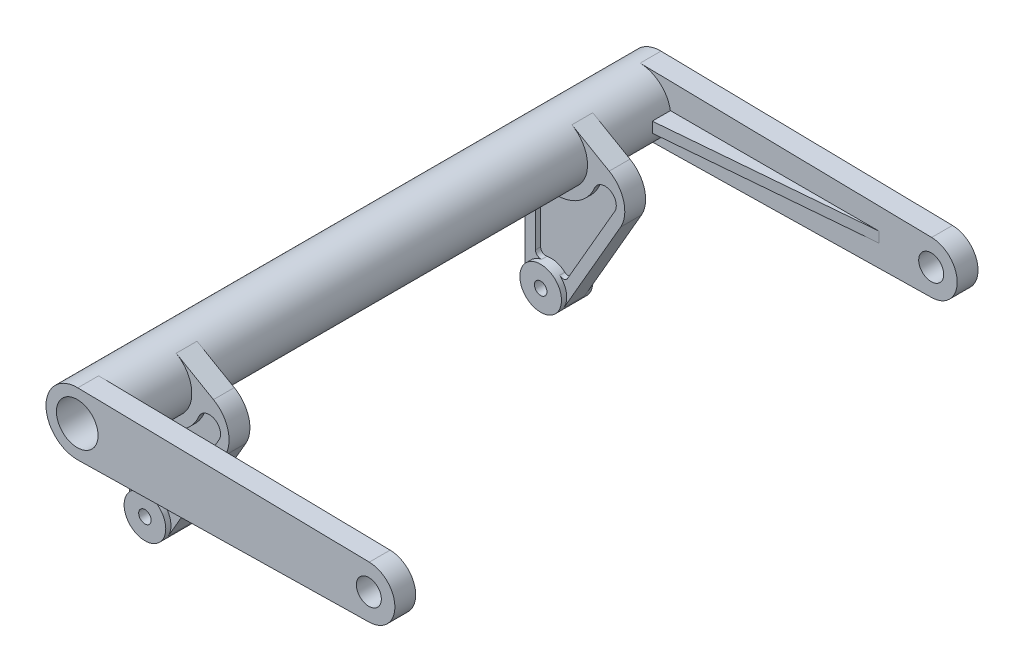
ISO-10303-21;
HEADER;
FILE_DESCRIPTION(('STEP AP214'),'2;1');
FILE_NAME('part.step','',(''),(''),'','','');
FILE_SCHEMA(('AUTOMOTIVE_DESIGN { 1 0 10303 214 1 1 1 1 }'));
ENDSEC;
DATA;
#1=APPLICATION_CONTEXT('core data for automotive mechanical design processes');
#2=APPLICATION_PROTOCOL_DEFINITION('international standard','automotive_design',2000,#1);
#3=PRODUCT_CONTEXT('',#1,'mechanical');
#4=PRODUCT('Part','Part','',(#3));
#5=PRODUCT_RELATED_PRODUCT_CATEGORY('part','',(#4));
#6=PRODUCT_DEFINITION_FORMATION('','',#4);
#7=PRODUCT_DEFINITION_CONTEXT('part definition',#1,'design');
#8=PRODUCT_DEFINITION('design','',#6,#7);
#9=PRODUCT_DEFINITION_SHAPE('','',#8);
#10=(LENGTH_UNIT() NAMED_UNIT(*) SI_UNIT(.MILLI.,.METRE.));
#11=(NAMED_UNIT(*) PLANE_ANGLE_UNIT() SI_UNIT($,.RADIAN.));
#12=(NAMED_UNIT(*) SI_UNIT($,.STERADIAN.) SOLID_ANGLE_UNIT());
#13=UNCERTAINTY_MEASURE_WITH_UNIT(LENGTH_MEASURE(1.E-05),#10,'distance_accuracy_value','');
#14=(GEOMETRIC_REPRESENTATION_CONTEXT(3) GLOBAL_UNCERTAINTY_ASSIGNED_CONTEXT((#13)) GLOBAL_UNIT_ASSIGNED_CONTEXT((#10,
#11,#12)) REPRESENTATION_CONTEXT('',''));
#15=CARTESIAN_POINT('',(0.,0.,0.));
#16=DIRECTION('',(0.,0.,1.));
#17=DIRECTION('',(1.,0.,0.));
#18=AXIS2_PLACEMENT_3D('',#15,#16,#17);
#19=CARTESIAN_POINT('',(35.801270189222,-20.6698729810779,-180.));
#20=DIRECTION('',(0.,0.,1.));
#21=DIRECTION('',(-1.,0.,0.));
#22=AXIS2_PLACEMENT_3D('',#19,#20,#21);
#23=PLANE('',#22);
#24=CARTESIAN_POINT('',(-9.99999999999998,-120.,-180.));
#25=DIRECTION('',(0.,0.,-1.));
#26=DIRECTION('',(-1.,0.,0.));
#27=AXIS2_PLACEMENT_3D('',#24,#25,#26);
#28=CIRCLE('',#27,20.);
#29=CARTESIAN_POINT('',(-30.,-120.,-180.));
#30=VERTEX_POINT('',#29);
#31=CARTESIAN_POINT('',(-14.,-100.404082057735,-180.));
#32=VERTEX_POINT('',#31);
#33=EDGE_CURVE('E417',#30,#32,#28,.T.);
#34=ORIENTED_EDGE('',*,*,#33,.T.);
#35=CARTESIAN_POINT('',(-15.,-95.5051025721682,-180.));
#36=DIRECTION('',(0.,0.,-1.));
#37=DIRECTION('',(1.,0.,0.));
#38=AXIS2_PLACEMENT_3D('',#35,#36,#37);
#39=CIRCLE('',#38,5.);
#40=CARTESIAN_POINT('',(-20.,-95.5051025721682,-180.));
#41=VERTEX_POINT('',#40);
#42=EDGE_CURVE('E398',#32,#41,#39,.T.);
#43=ORIENTED_EDGE('',*,*,#42,.T.);
#44=DIRECTION('',(0.,1.,0.));
#45=VECTOR('',#44,1.);
#46=CARTESIAN_POINT('',(-20.,-42.4264068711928,-180.));
#47=LINE('',#46,#45);
#48=CARTESIAN_POINT('',(-20.,-42.4264068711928,-180.));
#49=VERTEX_POINT('',#48);
#50=EDGE_CURVE('E410',#41,#49,#47,.T.);
#51=ORIENTED_EDGE('',*,*,#50,.T.);
#52=CARTESIAN_POINT('',(-15.,-42.4264068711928,-180.));
#53=DIRECTION('',(0.,0.,-1.));
#54=DIRECTION('',(-1.,0.,0.));
#55=AXIS2_PLACEMENT_3D('',#52,#53,#54);
#56=CIRCLE('',#55,5.);
#57=CARTESIAN_POINT('',(-13.3333333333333,-37.7123616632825,-180.));
#58=VERTEX_POINT('',#57);
#59=EDGE_CURVE('E450',#49,#58,#56,.T.);
#60=ORIENTED_EDGE('',*,*,#59,.T.);
#61=CARTESIAN_POINT('',(0.,0.,-180.));
#62=DIRECTION('',(0.,0.,1.));
#63=DIRECTION('',(-1.,0.,0.));
#64=AXIS2_PLACEMENT_3D('',#61,#62,#63);
#65=CIRCLE('',#64,40.);
#66=CARTESIAN_POINT('',(36.7818501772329,-15.719271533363,-180.));
#67=VERTEX_POINT('',#66);
#68=EDGE_CURVE('E447',#58,#67,#65,.T.);
#69=ORIENTED_EDGE('',*,*,#68,.T.);
#70=CARTESIAN_POINT('',(46.760664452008,-19.9838664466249,-180.));
#71=DIRECTION('',(0.,0.,-1.));
#72=DIRECTION('',(-1.,0.,0.));
#73=AXIS2_PLACEMENT_3D('',#70,#71,#72);
#74=CIRCLE('',#73,10.8518894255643);
#75=CARTESIAN_POINT('',(56.1586763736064,-25.4098111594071,-180.));
#76=VERTEX_POINT('',#75);
#77=EDGE_CURVE('E45',#67,#76,#74,.T.);
#78=ORIENTED_EDGE('',*,*,#77,.T.);
#79=DIRECTION('',(-0.5,-0.866025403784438,0.));
#80=VECTOR('',#79,1.);
#81=CARTESIAN_POINT('',(56.1586763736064,-25.4098111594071,-180.));
#82=LINE('',#81,#80);
#83=CARTESIAN_POINT('',(10.9077027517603,-103.786796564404,-180.));
#84=VERTEX_POINT('',#83);
#85=EDGE_CURVE('E456',#76,#84,#82,.T.);
#86=ORIENTED_EDGE('',*,*,#85,.T.);
#87=CARTESIAN_POINT('',(6.57757573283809,-101.286796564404,-180.));
#88=DIRECTION('',(0.,0.,-1.));
#89=DIRECTION('',(1.,0.,0.));
#90=AXIS2_PLACEMENT_3D('',#87,#88,#89);
#91=CIRCLE('',#90,5.);
#92=CARTESIAN_POINT('',(3.26206058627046,-105.029437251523,-180.));
#93=VERTEX_POINT('',#92);
#94=EDGE_CURVE('E409',#84,#93,#91,.T.);
#95=ORIENTED_EDGE('',*,*,#94,.T.);
#96=CARTESIAN_POINT('',(7.32050807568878,-130.,-180.));
#97=VERTEX_POINT('',#96);
#98=EDGE_CURVE('E428',#93,#97,#28,.T.);
#99=ORIENTED_EDGE('',*,*,#98,.T.);
#100=DIRECTION('',(0.500000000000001,0.866025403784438,0.));
#101=VECTOR('',#100,1.);
#102=CARTESIAN_POINT('',(61.7820323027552,-35.6698729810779,-180.));
#103=LINE('',#102,#101);
#104=CARTESIAN_POINT('',(61.7820323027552,-35.6698729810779,-180.));
#105=VERTEX_POINT('',#104);
#106=EDGE_CURVE('E554',#97,#105,#103,.T.);
#107=ORIENTED_EDGE('',*,*,#106,.T.);
#108=CARTESIAN_POINT('',(35.801270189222,-20.6698729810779,-180.));
#109=DIRECTION('',(0.,0.,1.));
#110=DIRECTION('',(-1.,0.,0.));
#111=AXIS2_PLACEMENT_3D('',#108,#109,#110);
#112=CIRCLE('',#111,30.);
#113=CARTESIAN_POINT('',(50.8012701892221,5.31088913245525,-180.));
#114=VERTEX_POINT('',#113);
#115=EDGE_CURVE('E551',#105,#114,#112,.T.);
#116=ORIENTED_EDGE('',*,*,#115,.T.);
#117=DIRECTION('',(-0.866025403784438,0.500000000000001,0.));
#118=VECTOR('',#117,1.);
#119=CARTESIAN_POINT('',(15.,25.9807621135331,-180.));
#120=LINE('',#119,#118);
#121=CARTESIAN_POINT('',(15.,25.9807621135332,-180.));
#122=VERTEX_POINT('',#121);
#123=EDGE_CURVE('E557',#114,#122,#120,.T.);
#124=ORIENTED_EDGE('',*,*,#123,.T.);
#125=CARTESIAN_POINT('',(0.,0.,-180.));
#126=DIRECTION('',(0.,0.,1.));
#127=DIRECTION('',(1.,0.,0.));
#128=AXIS2_PLACEMENT_3D('',#125,#126,#127);
#129=CIRCLE('',#128,30.);
#130=CARTESIAN_POINT('',(-30.,0.,-180.));
#131=VERTEX_POINT('',#130);
#132=EDGE_CURVE('E11',#131,#122,#129,.T.);
#133=ORIENTED_EDGE('',*,*,#132,.F.);
#134=DIRECTION('',(0.,-1.,0.));
#135=VECTOR('',#134,1.);
#136=CARTESIAN_POINT('',(-30.,0.,-180.));
#137=LINE('',#136,#135);
#138=EDGE_CURVE('E425',#131,#30,#137,.T.);
#139=ORIENTED_EDGE('',*,*,#138,.T.);
#140=EDGE_LOOP('',(#34,#43,#51,#60,#69,#78,#86,#95,#99,#107,#116,#124,#133,#139));
#141=FACE_BOUND('',#140,.T.);
#142=ADVANCED_FACE('F30',(#141),#23,.T.);
#143=CARTESIAN_POINT('',(35.801270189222,-20.6698729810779,-200.));
#144=DIRECTION('',(0.,0.,1.));
#145=DIRECTION('',(-1.,0.,0.));
#146=AXIS2_PLACEMENT_3D('',#143,#144,#145);
#147=PLANE('',#146);
#148=CARTESIAN_POINT('',(-15.,-95.5051025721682,-200.));
#149=DIRECTION('',(0.,0.,1.));
#150=DIRECTION('',(1.,0.,0.));
#151=AXIS2_PLACEMENT_3D('',#148,#149,#150);
#152=CIRCLE('',#151,5.);
#153=CARTESIAN_POINT('',(-20.,-95.5051025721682,-200.));
#154=VERTEX_POINT('',#153);
#155=CARTESIAN_POINT('',(-14.,-100.404082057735,-200.));
#156=VERTEX_POINT('',#155);
#157=EDGE_CURVE('E494',#154,#156,#152,.T.);
#158=ORIENTED_EDGE('',*,*,#157,.T.);
#159=CARTESIAN_POINT('',(-9.99999999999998,-120.,-200.));
#160=DIRECTION('',(0.,0.,1.));
#161=DIRECTION('',(1.,0.,0.));
#162=AXIS2_PLACEMENT_3D('',#159,#160,#161);
#163=CIRCLE('',#162,20.);
#164=CARTESIAN_POINT('',(-30.,-120.,-200.));
#165=VERTEX_POINT('',#164);
#166=EDGE_CURVE('E442',#156,#165,#163,.T.);
#167=ORIENTED_EDGE('',*,*,#166,.T.);
#168=DIRECTION('',(0.,-1.,0.));
#169=VECTOR('',#168,1.);
#170=CARTESIAN_POINT('',(-30.,0.,-200.));
#171=LINE('',#170,#169);
#172=CARTESIAN_POINT('',(-30.,0.,-200.));
#173=VERTEX_POINT('',#172);
#174=EDGE_CURVE('E545',#173,#165,#171,.T.);
#175=ORIENTED_EDGE('',*,*,#174,.F.);
#176=CARTESIAN_POINT('',(0.,0.,-200.));
#177=DIRECTION('',(0.,0.,1.));
#178=DIRECTION('',(1.,0.,0.));
#179=AXIS2_PLACEMENT_3D('',#176,#177,#178);
#180=CIRCLE('',#179,30.);
#181=CARTESIAN_POINT('',(15.,25.9807621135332,-200.));
#182=VERTEX_POINT('',#181);
#183=EDGE_CURVE('E38',#173,#182,#180,.T.);
#184=ORIENTED_EDGE('',*,*,#183,.T.);
#185=DIRECTION('',(-0.866025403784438,0.500000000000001,0.));
#186=VECTOR('',#185,1.);
#187=CARTESIAN_POINT('',(15.,25.9807621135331,-200.));
#188=LINE('',#187,#186);
#189=CARTESIAN_POINT('',(50.8012701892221,5.31088913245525,-200.));
#190=VERTEX_POINT('',#189);
#191=EDGE_CURVE('E548',#190,#182,#188,.T.);
#192=ORIENTED_EDGE('',*,*,#191,.F.);
#193=CARTESIAN_POINT('',(35.801270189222,-20.6698729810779,-200.));
#194=DIRECTION('',(0.,0.,1.));
#195=DIRECTION('',(-1.,0.,0.));
#196=AXIS2_PLACEMENT_3D('',#193,#194,#195);
#197=CIRCLE('',#196,30.);
#198=CARTESIAN_POINT('',(61.7820323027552,-35.6698729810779,-200.));
#199=VERTEX_POINT('',#198);
#200=EDGE_CURVE('E526',#199,#190,#197,.T.);
#201=ORIENTED_EDGE('',*,*,#200,.F.);
#202=DIRECTION('',(0.500000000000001,0.866025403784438,0.));
#203=VECTOR('',#202,1.);
#204=CARTESIAN_POINT('',(61.7820323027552,-35.6698729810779,-200.));
#205=LINE('',#204,#203);
#206=CARTESIAN_POINT('',(7.32050807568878,-130.,-200.));
#207=VERTEX_POINT('',#206);
#208=EDGE_CURVE('E543',#207,#199,#205,.T.);
#209=ORIENTED_EDGE('',*,*,#208,.F.);
#210=CARTESIAN_POINT('',(3.26206058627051,-105.029437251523,-200.));
#211=VERTEX_POINT('',#210);
#212=EDGE_CURVE('E439',#207,#211,#163,.T.);
#213=ORIENTED_EDGE('',*,*,#212,.T.);
#214=CARTESIAN_POINT('',(6.57757573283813,-101.286796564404,-200.));
#215=DIRECTION('',(0.,0.,1.));
#216=DIRECTION('',(-1.,0.,0.));
#217=AXIS2_PLACEMENT_3D('',#214,#215,#216);
#218=CIRCLE('',#217,5.);
#219=CARTESIAN_POINT('',(10.9077027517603,-103.786796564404,-200.));
#220=VERTEX_POINT('',#219);
#221=EDGE_CURVE('E491',#211,#220,#218,.T.);
#222=ORIENTED_EDGE('',*,*,#221,.T.);
#223=DIRECTION('',(0.500000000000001,0.866025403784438,0.));
#224=VECTOR('',#223,1.);
#225=CARTESIAN_POINT('',(56.1586763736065,-25.4098111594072,-200.));
#226=LINE('',#225,#224);
#227=CARTESIAN_POINT('',(56.1586763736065,-25.4098111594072,-200.));
#228=VERTEX_POINT('',#227);
#229=EDGE_CURVE('E488',#220,#228,#226,.T.);
#230=ORIENTED_EDGE('',*,*,#229,.T.);
#231=CARTESIAN_POINT('',(46.760664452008,-19.9838664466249,-200.));
#232=DIRECTION('',(0.,0.,1.));
#233=DIRECTION('',(1.,0.,0.));
#234=AXIS2_PLACEMENT_3D('',#231,#232,#233);
#235=CIRCLE('',#234,10.8518894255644);
#236=CARTESIAN_POINT('',(36.7818501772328,-15.719271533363,-200.));
#237=VERTEX_POINT('',#236);
#238=EDGE_CURVE('E53',#228,#237,#235,.T.);
#239=ORIENTED_EDGE('',*,*,#238,.T.);
#240=CARTESIAN_POINT('',(0.,0.,-200.));
#241=DIRECTION('',(0.,0.,-1.));
#242=DIRECTION('',(1.,0.,0.));
#243=AXIS2_PLACEMENT_3D('',#240,#241,#242);
#244=CIRCLE('',#243,40.);
#245=CARTESIAN_POINT('',(-13.3333333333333,-37.7123616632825,-200.));
#246=VERTEX_POINT('',#245);
#247=EDGE_CURVE('E503',#237,#246,#244,.T.);
#248=ORIENTED_EDGE('',*,*,#247,.T.);
#249=CARTESIAN_POINT('',(-15.,-42.4264068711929,-200.));
#250=DIRECTION('',(0.,0.,1.));
#251=DIRECTION('',(-1.,0.,0.));
#252=AXIS2_PLACEMENT_3D('',#249,#250,#251);
#253=CIRCLE('',#252,5.);
#254=CARTESIAN_POINT('',(-20.,-42.4264068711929,-200.));
#255=VERTEX_POINT('',#254);
#256=EDGE_CURVE('E500',#246,#255,#253,.T.);
#257=ORIENTED_EDGE('',*,*,#256,.T.);
#258=DIRECTION('',(0.,-1.,0.));
#259=VECTOR('',#258,1.);
#260=CARTESIAN_POINT('',(-20.,-42.4264068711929,-200.));
#261=LINE('',#260,#259);
#262=EDGE_CURVE('E497',#255,#154,#261,.T.);
#263=ORIENTED_EDGE('',*,*,#262,.T.);
#264=EDGE_LOOP('',(#158,#167,#175,#184,#192,#201,#209,#213,#222,#230,#239,#248,#257,#263));
#265=FACE_BOUND('',#264,.T.);
#266=ADVANCED_FACE('F886',(#265),#147,.F.);
#267=CARTESIAN_POINT('',(0.,0.,280.));
#268=DIRECTION('',(0.,0.,-1.));
#269=DIRECTION('',(-1.,0.,0.));
#270=AXIS2_PLACEMENT_3D('',#267,#268,#269);
#271=CYLINDRICAL_SURFACE('',#270,30.);
#272=ORIENTED_EDGE('',*,*,#132,.T.);
#273=DIRECTION('',(0.,0.,-1.));
#274=VECTOR('',#273,1.);
#275=CARTESIAN_POINT('',(15.,25.9807621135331,-180.));
#276=LINE('',#275,#274);
#277=EDGE_CURVE('E565',#122,#182,#276,.T.);
#278=ORIENTED_EDGE('',*,*,#277,.T.);
#279=ORIENTED_EDGE('',*,*,#183,.F.);
#280=DIRECTION('',(0.,0.,-1.));
#281=VECTOR('',#280,1.);
#282=CARTESIAN_POINT('',(-30.,0.,-180.));
#283=LINE('',#282,#281);
#284=EDGE_CURVE('E567',#131,#173,#283,.T.);
#285=ORIENTED_EDGE('',*,*,#284,.F.);
#286=EDGE_LOOP('',(#272,#278,#279,#285));
#287=FACE_BOUND('',#286,.T.);
#288=CARTESIAN_POINT('',(0.,0.,180.));
#289=DIRECTION('',(0.,0.,-1.));
#290=DIRECTION('',(-1.,0.,0.));
#291=AXIS2_PLACEMENT_3D('',#288,#289,#290);
#292=CIRCLE('',#291,30.);
#293=CARTESIAN_POINT('',(15.,25.9807621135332,180.));
#294=VERTEX_POINT('',#293);
#295=CARTESIAN_POINT('',(-30.,0.,180.));
#296=VERTEX_POINT('',#295);
#297=EDGE_CURVE('E873',#294,#296,#292,.T.);
#298=ORIENTED_EDGE('',*,*,#297,.T.);
#299=DIRECTION('',(0.,0.,1.));
#300=VECTOR('',#299,1.);
#301=CARTESIAN_POINT('',(-30.,0.,180.));
#302=LINE('',#301,#300);
#303=CARTESIAN_POINT('',(-30.,0.,200.));
#304=VERTEX_POINT('',#303);
#305=EDGE_CURVE('E801',#296,#304,#302,.T.);
#306=ORIENTED_EDGE('',*,*,#305,.T.);
#307=CARTESIAN_POINT('',(0.,0.,200.));
#308=DIRECTION('',(0.,0.,-1.));
#309=DIRECTION('',(-1.,0.,0.));
#310=AXIS2_PLACEMENT_3D('',#307,#308,#309);
#311=CIRCLE('',#310,30.);
#312=CARTESIAN_POINT('',(15.,25.9807621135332,200.));
#313=VERTEX_POINT('',#312);
#314=EDGE_CURVE('E870',#313,#304,#311,.T.);
#315=ORIENTED_EDGE('',*,*,#314,.F.);
#316=DIRECTION('',(0.,0.,1.));
#317=VECTOR('',#316,1.);
#318=CARTESIAN_POINT('',(15.,25.9807621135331,180.));
#319=LINE('',#318,#317);
#320=EDGE_CURVE('E803',#294,#313,#319,.T.);
#321=ORIENTED_EDGE('',*,*,#320,.F.);
#322=EDGE_LOOP('',(#298,#306,#315,#321));
#323=FACE_BOUND('',#322,.T.);
#324=DIRECTION('',(0.,0.,-1.));
#325=VECTOR('',#324,1.);
#326=CARTESIAN_POINT('',(29.5803989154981,5.,280.));
#327=LINE('',#326,#325);
#328=CARTESIAN_POINT('',(29.5803989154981,5.,242.572208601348));
#329=VERTEX_POINT('',#328);
#330=CARTESIAN_POINT('',(29.5803989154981,5.,260.));
#331=VERTEX_POINT('',#330);
#332=EDGE_CURVE('E818',#329,#331,#327,.F.);
#333=ORIENTED_EDGE('',*,*,#332,.F.);
#334=CARTESIAN_POINT('',(0.,0.,240.));
#335=DIRECTION('',(-0.0866296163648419,0.,0.996240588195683));
#336=DIRECTION('',(-0.996240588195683,0.,-0.0866296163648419));
#337=AXIS2_PLACEMENT_3D('',#334,#335,#336);
#338=ELLIPSE('',#337,30.1132079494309,30.);
#339=CARTESIAN_POINT('',(29.5803989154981,-5.,242.572208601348));
#340=VERTEX_POINT('',#339);
#341=EDGE_CURVE('E820',#340,#329,#338,.T.);
#342=ORIENTED_EDGE('',*,*,#341,.F.);
#343=DIRECTION('',(0.,0.,-1.));
#344=VECTOR('',#343,1.);
#345=CARTESIAN_POINT('',(29.5803989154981,-5.,280.));
#346=LINE('',#345,#344);
#347=CARTESIAN_POINT('',(29.5803989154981,-5.,260.));
#348=VERTEX_POINT('',#347);
#349=EDGE_CURVE('E815',#340,#348,#346,.F.);
#350=ORIENTED_EDGE('',*,*,#349,.T.);
#351=CARTESIAN_POINT('',(0.,0.,260.));
#352=DIRECTION('',(0.,0.,1.));
#353=DIRECTION('',(1.,0.,0.));
#354=AXIS2_PLACEMENT_3D('',#351,#352,#353);
#355=CIRCLE('',#354,30.);
#356=CARTESIAN_POINT('',(0.535714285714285,-29.995216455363,260.));
#357=VERTEX_POINT('',#356);
#358=EDGE_CURVE('E862',#357,#348,#355,.T.);
#359=ORIENTED_EDGE('',*,*,#358,.F.);
#360=DIRECTION('',(0.,0.,1.));
#361=VECTOR('',#360,1.);
#362=CARTESIAN_POINT('',(0.535714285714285,-29.995216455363,260.));
#363=LINE('',#362,#361);
#364=CARTESIAN_POINT('',(0.535714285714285,-29.995216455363,280.));
#365=VERTEX_POINT('',#364);
#366=EDGE_CURVE('E845',#357,#365,#363,.T.);
#367=ORIENTED_EDGE('',*,*,#366,.T.);
#368=CARTESIAN_POINT('',(0.,0.,280.));
#369=DIRECTION('',(0.,0.,1.));
#370=DIRECTION('',(1.,0.,0.));
#371=AXIS2_PLACEMENT_3D('',#368,#369,#370);
#372=CIRCLE('',#371,30.);
#373=CARTESIAN_POINT('',(0.535714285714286,29.9952164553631,280.));
#374=VERTEX_POINT('',#373);
#375=EDGE_CURVE('E858',#374,#365,#372,.T.);
#376=ORIENTED_EDGE('',*,*,#375,.F.);
#377=DIRECTION('',(0.,0.,1.));
#378=VECTOR('',#377,1.);
#379=CARTESIAN_POINT('',(0.535714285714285,29.995216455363,260.));
#380=LINE('',#379,#378);
#381=CARTESIAN_POINT('',(0.535714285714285,29.995216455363,260.));
#382=VERTEX_POINT('',#381);
#383=EDGE_CURVE('E846',#382,#374,#380,.T.);
#384=ORIENTED_EDGE('',*,*,#383,.F.);
#385=EDGE_CURVE('E861',#331,#382,#355,.T.);
#386=ORIENTED_EDGE('',*,*,#385,.F.);
#387=EDGE_LOOP('',(#333,#342,#350,#359,#367,#376,#384,#386));
#388=FACE_BOUND('',#387,.T.);
#389=DIRECTION('',(0.,0.,-1.));
#390=VECTOR('',#389,1.);
#391=CARTESIAN_POINT('',(29.5803989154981,5.,280.));
#392=LINE('',#391,#390);
#393=CARTESIAN_POINT('',(29.5803989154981,5.,-260.));
#394=VERTEX_POINT('',#393);
#395=CARTESIAN_POINT('',(29.5803989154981,5.,-242.572208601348));
#396=VERTEX_POINT('',#395);
#397=EDGE_CURVE('E588',#394,#396,#392,.F.);
#398=ORIENTED_EDGE('',*,*,#397,.F.);
#399=CARTESIAN_POINT('',(0.,0.,-260.));
#400=DIRECTION('',(0.,0.,-1.));
#401=DIRECTION('',(-1.,0.,0.));
#402=AXIS2_PLACEMENT_3D('',#399,#400,#401);
#403=CIRCLE('',#402,30.);
#404=CARTESIAN_POINT('',(0.535714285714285,29.995216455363,-260.));
#405=VERTEX_POINT('',#404);
#406=EDGE_CURVE('E876',#405,#394,#403,.T.);
#407=ORIENTED_EDGE('',*,*,#406,.F.);
#408=DIRECTION('',(0.,0.,-1.));
#409=VECTOR('',#408,1.);
#410=CARTESIAN_POINT('',(0.535714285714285,29.995216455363,-260.));
#411=LINE('',#410,#409);
#412=CARTESIAN_POINT('',(0.535714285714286,29.9952164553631,-280.));
#413=VERTEX_POINT('',#412);
#414=EDGE_CURVE('E611',#405,#413,#411,.T.);
#415=ORIENTED_EDGE('',*,*,#414,.T.);
#416=CARTESIAN_POINT('',(0.,0.,-280.));
#417=DIRECTION('',(0.,0.,1.));
#418=DIRECTION('',(1.,0.,0.));
#419=AXIS2_PLACEMENT_3D('',#416,#417,#418);
#420=CIRCLE('',#419,30.);
#421=CARTESIAN_POINT('',(0.535714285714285,-29.995216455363,-280.));
#422=VERTEX_POINT('',#421);
#423=EDGE_CURVE('E849',#413,#422,#420,.T.);
#424=ORIENTED_EDGE('',*,*,#423,.T.);
#425=DIRECTION('',(0.,0.,-1.));
#426=VECTOR('',#425,1.);
#427=CARTESIAN_POINT('',(0.535714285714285,-29.995216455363,-260.));
#428=LINE('',#427,#426);
#429=CARTESIAN_POINT('',(0.535714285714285,-29.995216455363,-260.));
#430=VERTEX_POINT('',#429);
#431=EDGE_CURVE('E612',#430,#422,#428,.T.);
#432=ORIENTED_EDGE('',*,*,#431,.F.);
#433=CARTESIAN_POINT('',(29.5803989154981,-5.,-260.));
#434=VERTEX_POINT('',#433);
#435=EDGE_CURVE('E875',#434,#430,#403,.T.);
#436=ORIENTED_EDGE('',*,*,#435,.F.);
#437=DIRECTION('',(0.,0.,-1.));
#438=VECTOR('',#437,1.);
#439=CARTESIAN_POINT('',(29.5803989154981,-5.,280.));
#440=LINE('',#439,#438);
#441=CARTESIAN_POINT('',(29.5803989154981,-5.,-242.572208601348));
#442=VERTEX_POINT('',#441);
#443=EDGE_CURVE('E585',#434,#442,#440,.F.);
#444=ORIENTED_EDGE('',*,*,#443,.T.);
#445=CARTESIAN_POINT('',(0.,0.,-240.));
#446=DIRECTION('',(0.0866296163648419,0.,0.996240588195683));
#447=DIRECTION('',(0.996240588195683,0.,-0.0866296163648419));
#448=AXIS2_PLACEMENT_3D('',#445,#446,#447);
#449=ELLIPSE('',#448,30.1132079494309,30.);
#450=EDGE_CURVE('E590',#442,#396,#449,.T.);
#451=ORIENTED_EDGE('',*,*,#450,.T.);
#452=EDGE_LOOP('',(#398,#407,#415,#424,#432,#436,#444,#451));
#453=FACE_BOUND('',#452,.T.);
#454=ADVANCED_FACE('F32',(#287,#323,#388,#453),#271,.T.);
#455=CARTESIAN_POINT('',(0.,0.,-260.));
#456=DIRECTION('',(0.,0.,-1.));
#457=DIRECTION('',(1.,0.,0.));
#458=AXIS2_PLACEMENT_3D('',#455,#456,#457);
#459=PLANE('',#458);
#460=CARTESIAN_POINT('',(280.,0.,-260.));
#461=DIRECTION('',(0.,0.,1.));
#462=DIRECTION('',(1.,0.,0.));
#463=AXIS2_PLACEMENT_3D('',#460,#461,#462);
#464=CIRCLE('',#463,12.);
#465=CARTESIAN_POINT('',(292.,0.,-260.));
#466=VERTEX_POINT('',#465);
#467=EDGE_CURVE('E596',#466,#466,#464,.T.);
#468=ORIENTED_EDGE('',*,*,#467,.F.);
#469=EDGE_LOOP('',(#468));
#470=FACE_BOUND('',#469,.T.);
#471=DIRECTION('',(-1.,0.,0.));
#472=VECTOR('',#471,1.);
#473=CARTESIAN_POINT('',(0.,5.,-260.));
#474=LINE('',#473,#472);
#475=CARTESIAN_POINT('',(230.,5.,-260.));
#476=VERTEX_POINT('',#475);
#477=EDGE_CURVE('E882',#476,#394,#474,.T.);
#478=ORIENTED_EDGE('',*,*,#477,.F.);
#479=DIRECTION('',(0.,-1.,0.));
#480=VECTOR('',#479,1.);
#481=CARTESIAN_POINT('',(230.,5.,-260.));
#482=LINE('',#481,#480);
#483=CARTESIAN_POINT('',(230.,-5.,-260.));
#484=VERTEX_POINT('',#483);
#485=EDGE_CURVE('E582',#476,#484,#482,.T.);
#486=ORIENTED_EDGE('',*,*,#485,.T.);
#487=DIRECTION('',(-1.,0.,0.));
#488=VECTOR('',#487,1.);
#489=CARTESIAN_POINT('',(0.,-5.,-260.));
#490=LINE('',#489,#488);
#491=EDGE_CURVE('E879',#484,#434,#490,.T.);
#492=ORIENTED_EDGE('',*,*,#491,.T.);
#493=ORIENTED_EDGE('',*,*,#435,.T.);
#494=DIRECTION('',(0.999840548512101,0.0178571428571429,0.));
#495=VECTOR('',#494,1.);
#496=CARTESIAN_POINT('',(0.535714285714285,-29.995216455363,-260.));
#497=LINE('',#496,#495);
#498=CARTESIAN_POINT('',(280.446428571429,-24.9960137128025,-260.));
#499=VERTEX_POINT('',#498);
#500=EDGE_CURVE('E609',#430,#499,#497,.T.);
#501=ORIENTED_EDGE('',*,*,#500,.T.);
#502=CARTESIAN_POINT('',(280.,0.,-260.));
#503=DIRECTION('',(0.,0.,1.));
#504=DIRECTION('',(1.,0.,0.));
#505=AXIS2_PLACEMENT_3D('',#502,#503,#504);
#506=CIRCLE('',#505,25.);
#507=CARTESIAN_POINT('',(280.446428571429,24.9960137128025,-260.));
#508=VERTEX_POINT('',#507);
#509=EDGE_CURVE('E607',#499,#508,#506,.T.);
#510=ORIENTED_EDGE('',*,*,#509,.T.);
#511=DIRECTION('',(-0.999840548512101,0.0178571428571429,0.));
#512=VECTOR('',#511,1.);
#513=CARTESIAN_POINT('',(0.535714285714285,29.995216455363,-260.));
#514=LINE('',#513,#512);
#515=EDGE_CURVE('E605',#508,#405,#514,.T.);
#516=ORIENTED_EDGE('',*,*,#515,.T.);
#517=ORIENTED_EDGE('',*,*,#406,.T.);
#518=EDGE_LOOP('',(#478,#486,#492,#493,#501,#510,#516,#517));
#519=FACE_BOUND('',#518,.T.);
#520=ADVANCED_FACE('F1208',(#470,#519),#459,.F.);
#521=CARTESIAN_POINT('',(35.801270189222,-20.6698729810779,180.));
#522=DIRECTION('',(0.,0.,-1.));
#523=DIRECTION('',(-1.,0.,0.));
#524=AXIS2_PLACEMENT_3D('',#521,#522,#523);
#525=PLANE('',#524);
#526=DIRECTION('',(0.500000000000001,0.866025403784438,0.));
#527=VECTOR('',#526,1.);
#528=CARTESIAN_POINT('',(61.7820323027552,-35.6698729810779,180.));
#529=LINE('',#528,#527);
#530=CARTESIAN_POINT('',(7.3205080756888,-130.,180.));
#531=VERTEX_POINT('',#530);
#532=CARTESIAN_POINT('',(61.7820323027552,-35.6698729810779,180.));
#533=VERTEX_POINT('',#532);
#534=EDGE_CURVE('E788',#531,#533,#529,.T.);
#535=ORIENTED_EDGE('',*,*,#534,.F.);
#536=CARTESIAN_POINT('',(-9.99999999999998,-120.,180.));
#537=DIRECTION('',(0.,0.,-1.));
#538=DIRECTION('',(-1.,0.,0.));
#539=AXIS2_PLACEMENT_3D('',#536,#537,#538);
#540=CIRCLE('',#539,20.);
#541=CARTESIAN_POINT('',(3.26206058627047,-105.029437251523,180.));
#542=VERTEX_POINT('',#541);
#543=EDGE_CURVE('E626',#542,#531,#540,.T.);
#544=ORIENTED_EDGE('',*,*,#543,.F.);
#545=CARTESIAN_POINT('',(6.57757573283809,-101.286796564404,180.));
#546=DIRECTION('',(0.,0.,-1.));
#547=DIRECTION('',(1.,0.,0.));
#548=AXIS2_PLACEMENT_3D('',#545,#546,#547);
#549=CIRCLE('',#548,5.);
#550=CARTESIAN_POINT('',(10.9077027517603,-103.786796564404,180.));
#551=VERTEX_POINT('',#550);
#552=EDGE_CURVE('E646',#551,#542,#549,.T.);
#553=ORIENTED_EDGE('',*,*,#552,.F.);
#554=DIRECTION('',(-0.5,-0.866025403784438,0.));
#555=VECTOR('',#554,1.);
#556=CARTESIAN_POINT('',(56.1586763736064,-25.4098111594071,180.));
#557=LINE('',#556,#555);
#558=CARTESIAN_POINT('',(56.1586763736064,-25.4098111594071,180.));
#559=VERTEX_POINT('',#558);
#560=EDGE_CURVE('E643',#559,#551,#557,.T.);
#561=ORIENTED_EDGE('',*,*,#560,.F.);
#562=CARTESIAN_POINT('',(46.760664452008,-19.9838664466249,180.));
#563=DIRECTION('',(0.,0.,-1.));
#564=DIRECTION('',(-1.,0.,0.));
#565=AXIS2_PLACEMENT_3D('',#562,#563,#564);
#566=CIRCLE('',#565,10.8518894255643);
#567=CARTESIAN_POINT('',(36.7818501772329,-15.719271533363,180.));
#568=VERTEX_POINT('',#567);
#569=EDGE_CURVE('E641',#568,#559,#566,.T.);
#570=ORIENTED_EDGE('',*,*,#569,.F.);
#571=CARTESIAN_POINT('',(0.,0.,180.));
#572=DIRECTION('',(0.,0.,1.));
#573=DIRECTION('',(-1.,0.,0.));
#574=AXIS2_PLACEMENT_3D('',#571,#572,#573);
#575=CIRCLE('',#574,40.);
#576=CARTESIAN_POINT('',(-13.3333333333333,-37.7123616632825,180.));
#577=VERTEX_POINT('',#576);
#578=EDGE_CURVE('E658',#577,#568,#575,.T.);
#579=ORIENTED_EDGE('',*,*,#578,.F.);
#580=CARTESIAN_POINT('',(-15.,-42.4264068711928,180.));
#581=DIRECTION('',(0.,0.,-1.));
#582=DIRECTION('',(-1.,0.,0.));
#583=AXIS2_PLACEMENT_3D('',#580,#581,#582);
#584=CIRCLE('',#583,5.);
#585=CARTESIAN_POINT('',(-20.,-42.4264068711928,180.));
#586=VERTEX_POINT('',#585);
#587=EDGE_CURVE('E655',#586,#577,#584,.T.);
#588=ORIENTED_EDGE('',*,*,#587,.F.);
#589=DIRECTION('',(0.,1.,0.));
#590=VECTOR('',#589,1.);
#591=CARTESIAN_POINT('',(-20.,-42.4264068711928,180.));
#592=LINE('',#591,#590);
#593=CARTESIAN_POINT('',(-20.,-95.5051025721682,180.));
#594=VERTEX_POINT('',#593);
#595=EDGE_CURVE('E652',#594,#586,#592,.T.);
#596=ORIENTED_EDGE('',*,*,#595,.F.);
#597=CARTESIAN_POINT('',(-15.,-95.5051025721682,180.));
#598=DIRECTION('',(0.,0.,-1.));
#599=DIRECTION('',(1.,0.,0.));
#600=AXIS2_PLACEMENT_3D('',#597,#598,#599);
#601=CIRCLE('',#600,5.);
#602=CARTESIAN_POINT('',(-14.,-100.404082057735,180.));
#603=VERTEX_POINT('',#602);
#604=EDGE_CURVE('E649',#603,#594,#601,.T.);
#605=ORIENTED_EDGE('',*,*,#604,.F.);
#606=CARTESIAN_POINT('',(-30.,-120.,180.));
#607=VERTEX_POINT('',#606);
#608=EDGE_CURVE('E627',#607,#603,#540,.T.);
#609=ORIENTED_EDGE('',*,*,#608,.F.);
#610=DIRECTION('',(0.,-1.,0.));
#611=VECTOR('',#610,1.);
#612=CARTESIAN_POINT('',(-30.,0.,180.));
#613=LINE('',#612,#611);
#614=EDGE_CURVE('E785',#296,#607,#613,.T.);
#615=ORIENTED_EDGE('',*,*,#614,.F.);
#616=ORIENTED_EDGE('',*,*,#297,.F.);
#617=DIRECTION('',(-0.866025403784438,0.500000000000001,0.));
#618=VECTOR('',#617,1.);
#619=CARTESIAN_POINT('',(15.,25.9807621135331,180.));
#620=LINE('',#619,#618);
#621=CARTESIAN_POINT('',(50.8012701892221,5.31088913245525,180.));
#622=VERTEX_POINT('',#621);
#623=EDGE_CURVE('E782',#622,#294,#620,.T.);
#624=ORIENTED_EDGE('',*,*,#623,.F.);
#625=CARTESIAN_POINT('',(35.801270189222,-20.6698729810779,180.));
#626=DIRECTION('',(0.,0.,1.));
#627=DIRECTION('',(-1.,0.,0.));
#628=AXIS2_PLACEMENT_3D('',#625,#626,#627);
#629=CIRCLE('',#628,30.);
#630=EDGE_CURVE('E779',#533,#622,#629,.T.);
#631=ORIENTED_EDGE('',*,*,#630,.F.);
#632=EDGE_LOOP('',(#535,#544,#553,#561,#570,#579,#588,#596,#605,#609,#615,#616,#624,#631));
#633=FACE_BOUND('',#632,.T.);
#634=ADVANCED_FACE('F1211',(#633),#525,.T.);
#635=CARTESIAN_POINT('',(35.801270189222,-20.6698729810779,200.));
#636=DIRECTION('',(0.,0.,-1.));
#637=DIRECTION('',(-1.,0.,0.));
#638=AXIS2_PLACEMENT_3D('',#635,#636,#637);
#639=PLANE('',#638);
#640=CARTESIAN_POINT('',(-9.99999999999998,-120.,200.));
#641=DIRECTION('',(0.,0.,1.));
#642=DIRECTION('',(1.,0.,0.));
#643=AXIS2_PLACEMENT_3D('',#640,#641,#642);
#644=CIRCLE('',#643,20.);
#645=CARTESIAN_POINT('',(7.32050807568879,-130.,200.));
#646=VERTEX_POINT('',#645);
#647=CARTESIAN_POINT('',(3.26206058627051,-105.029437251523,200.));
#648=VERTEX_POINT('',#647);
#649=EDGE_CURVE('E635',#646,#648,#644,.T.);
#650=ORIENTED_EDGE('',*,*,#649,.F.);
#651=DIRECTION('',(0.500000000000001,0.866025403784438,0.));
#652=VECTOR('',#651,1.);
#653=CARTESIAN_POINT('',(61.7820323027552,-35.6698729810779,200.));
#654=LINE('',#653,#652);
#655=CARTESIAN_POINT('',(61.7820323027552,-35.6698729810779,200.));
#656=VERTEX_POINT('',#655);
#657=EDGE_CURVE('E776',#646,#656,#654,.T.);
#658=ORIENTED_EDGE('',*,*,#657,.T.);
#659=CARTESIAN_POINT('',(35.801270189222,-20.6698729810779,200.));
#660=DIRECTION('',(0.,0.,1.));
#661=DIRECTION('',(-1.,0.,0.));
#662=AXIS2_PLACEMENT_3D('',#659,#660,#661);
#663=CIRCLE('',#662,30.);
#664=CARTESIAN_POINT('',(50.8012701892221,5.31088913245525,200.));
#665=VERTEX_POINT('',#664);
#666=EDGE_CURVE('E751',#656,#665,#663,.T.);
#667=ORIENTED_EDGE('',*,*,#666,.T.);
#668=DIRECTION('',(-0.866025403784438,0.500000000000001,0.));
#669=VECTOR('',#668,1.);
#670=CARTESIAN_POINT('',(15.,25.9807621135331,200.));
#671=LINE('',#670,#669);
#672=EDGE_CURVE('E770',#665,#313,#671,.T.);
#673=ORIENTED_EDGE('',*,*,#672,.T.);
#674=ORIENTED_EDGE('',*,*,#314,.T.);
#675=DIRECTION('',(0.,-1.,0.));
#676=VECTOR('',#675,1.);
#677=CARTESIAN_POINT('',(-30.,0.,200.));
#678=LINE('',#677,#676);
#679=CARTESIAN_POINT('',(-30.,-120.,200.));
#680=VERTEX_POINT('',#679);
#681=EDGE_CURVE('E773',#304,#680,#678,.T.);
#682=ORIENTED_EDGE('',*,*,#681,.T.);
#683=CARTESIAN_POINT('',(-14.,-100.404082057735,200.));
#684=VERTEX_POINT('',#683);
#685=EDGE_CURVE('E637',#684,#680,#644,.T.);
#686=ORIENTED_EDGE('',*,*,#685,.F.);
#687=CARTESIAN_POINT('',(-15.,-95.5051025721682,200.));
#688=DIRECTION('',(0.,0.,1.));
#689=DIRECTION('',(1.,0.,0.));
#690=AXIS2_PLACEMENT_3D('',#687,#688,#689);
#691=CIRCLE('',#690,5.);
#692=CARTESIAN_POINT('',(-20.,-95.5051025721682,200.));
#693=VERTEX_POINT('',#692);
#694=EDGE_CURVE('E715',#693,#684,#691,.T.);
#695=ORIENTED_EDGE('',*,*,#694,.F.);
#696=DIRECTION('',(0.,-1.,0.));
#697=VECTOR('',#696,1.);
#698=CARTESIAN_POINT('',(-20.,-42.4264068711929,200.));
#699=LINE('',#698,#697);
#700=CARTESIAN_POINT('',(-20.,-42.4264068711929,200.));
#701=VERTEX_POINT('',#700);
#702=EDGE_CURVE('E712',#701,#693,#699,.T.);
#703=ORIENTED_EDGE('',*,*,#702,.F.);
#704=CARTESIAN_POINT('',(-15.,-42.4264068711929,200.));
#705=DIRECTION('',(0.,0.,1.));
#706=DIRECTION('',(-1.,0.,0.));
#707=AXIS2_PLACEMENT_3D('',#704,#705,#706);
#708=CIRCLE('',#707,5.);
#709=CARTESIAN_POINT('',(-13.3333333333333,-37.7123616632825,200.));
#710=VERTEX_POINT('',#709);
#711=EDGE_CURVE('E709',#710,#701,#708,.T.);
#712=ORIENTED_EDGE('',*,*,#711,.F.);
#713=CARTESIAN_POINT('',(0.,0.,200.));
#714=DIRECTION('',(0.,0.,-1.));
#715=DIRECTION('',(1.,0.,0.));
#716=AXIS2_PLACEMENT_3D('',#713,#714,#715);
#717=CIRCLE('',#716,40.);
#718=CARTESIAN_POINT('',(36.7818501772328,-15.719271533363,200.));
#719=VERTEX_POINT('',#718);
#720=EDGE_CURVE('E706',#719,#710,#717,.T.);
#721=ORIENTED_EDGE('',*,*,#720,.F.);
#722=CARTESIAN_POINT('',(46.760664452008,-19.9838664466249,200.));
#723=DIRECTION('',(0.,0.,1.));
#724=DIRECTION('',(1.,0.,0.));
#725=AXIS2_PLACEMENT_3D('',#722,#723,#724);
#726=CIRCLE('',#725,10.8518894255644);
#727=CARTESIAN_POINT('',(56.1586763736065,-25.4098111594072,200.));
#728=VERTEX_POINT('',#727);
#729=EDGE_CURVE('E688',#728,#719,#726,.T.);
#730=ORIENTED_EDGE('',*,*,#729,.F.);
#731=DIRECTION('',(0.500000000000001,0.866025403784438,0.));
#732=VECTOR('',#731,1.);
#733=CARTESIAN_POINT('',(56.1586763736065,-25.4098111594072,200.));
#734=LINE('',#733,#732);
#735=CARTESIAN_POINT('',(10.9077027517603,-103.786796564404,200.));
#736=VERTEX_POINT('',#735);
#737=EDGE_CURVE('E721',#736,#728,#734,.T.);
#738=ORIENTED_EDGE('',*,*,#737,.F.);
#739=CARTESIAN_POINT('',(6.57757573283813,-101.286796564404,200.));
#740=DIRECTION('',(0.,0.,1.));
#741=DIRECTION('',(-1.,0.,0.));
#742=AXIS2_PLACEMENT_3D('',#739,#740,#741);
#743=CIRCLE('',#742,5.);
#744=EDGE_CURVE('E718',#648,#736,#743,.T.);
#745=ORIENTED_EDGE('',*,*,#744,.F.);
#746=EDGE_LOOP('',(#650,#658,#667,#673,#674,#682,#686,#695,#703,#712,#721,#730,#738,#745));
#747=FACE_BOUND('',#746,.T.);
#748=ADVANCED_FACE('F1297',(#747),#639,.F.);
#749=CARTESIAN_POINT('',(0.,0.,260.));
#750=DIRECTION('',(0.,0.,1.));
#751=DIRECTION('',(1.,0.,0.));
#752=AXIS2_PLACEMENT_3D('',#749,#750,#751);
#753=PLANE('',#752);
#754=CARTESIAN_POINT('',(280.,0.,260.));
#755=DIRECTION('',(0.,0.,1.));
#756=DIRECTION('',(1.,0.,0.));
#757=AXIS2_PLACEMENT_3D('',#754,#755,#756);
#758=CIRCLE('',#757,12.);
#759=CARTESIAN_POINT('',(292.,0.,260.));
#760=VERTEX_POINT('',#759);
#761=EDGE_CURVE('E825',#760,#760,#758,.T.);
#762=ORIENTED_EDGE('',*,*,#761,.T.);
#763=EDGE_LOOP('',(#762));
#764=FACE_BOUND('',#763,.T.);
#765=DIRECTION('',(1.,0.,0.));
#766=VECTOR('',#765,1.);
#767=CARTESIAN_POINT('',(0.,5.,260.));
#768=LINE('',#767,#766);
#769=CARTESIAN_POINT('',(230.,5.,260.));
#770=VERTEX_POINT('',#769);
#771=EDGE_CURVE('E868',#331,#770,#768,.T.);
#772=ORIENTED_EDGE('',*,*,#771,.F.);
#773=ORIENTED_EDGE('',*,*,#385,.T.);
#774=DIRECTION('',(-0.999840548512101,0.0178571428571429,0.));
#775=VECTOR('',#774,1.);
#776=CARTESIAN_POINT('',(0.535714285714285,29.995216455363,260.));
#777=LINE('',#776,#775);
#778=CARTESIAN_POINT('',(280.446428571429,24.9960137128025,260.));
#779=VERTEX_POINT('',#778);
#780=EDGE_CURVE('E842',#779,#382,#777,.T.);
#781=ORIENTED_EDGE('',*,*,#780,.F.);
#782=CARTESIAN_POINT('',(280.,0.,260.));
#783=DIRECTION('',(0.,0.,1.));
#784=DIRECTION('',(1.,0.,0.));
#785=AXIS2_PLACEMENT_3D('',#782,#783,#784);
#786=CIRCLE('',#785,25.);
#787=CARTESIAN_POINT('',(280.446428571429,-24.9960137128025,260.));
#788=VERTEX_POINT('',#787);
#789=EDGE_CURVE('E839',#788,#779,#786,.T.);
#790=ORIENTED_EDGE('',*,*,#789,.F.);
#791=DIRECTION('',(0.999840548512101,0.0178571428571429,0.));
#792=VECTOR('',#791,1.);
#793=CARTESIAN_POINT('',(0.535714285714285,-29.995216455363,260.));
#794=LINE('',#793,#792);
#795=EDGE_CURVE('E836',#357,#788,#794,.T.);
#796=ORIENTED_EDGE('',*,*,#795,.F.);
#797=ORIENTED_EDGE('',*,*,#358,.T.);
#798=DIRECTION('',(1.,0.,0.));
#799=VECTOR('',#798,1.);
#800=CARTESIAN_POINT('',(0.,-5.,260.));
#801=LINE('',#800,#799);
#802=CARTESIAN_POINT('',(230.,-5.,260.));
#803=VERTEX_POINT('',#802);
#804=EDGE_CURVE('E865',#348,#803,#801,.T.);
#805=ORIENTED_EDGE('',*,*,#804,.T.);
#806=DIRECTION('',(0.,-1.,0.));
#807=VECTOR('',#806,1.);
#808=CARTESIAN_POINT('',(230.,5.,260.));
#809=LINE('',#808,#807);
#810=EDGE_CURVE('E812',#770,#803,#809,.T.);
#811=ORIENTED_EDGE('',*,*,#810,.F.);
#812=EDGE_LOOP('',(#772,#773,#781,#790,#796,#797,#805,#811));
#813=FACE_BOUND('',#812,.T.);
#814=ADVANCED_FACE('F1300',(#764,#813),#753,.F.);
#815=CARTESIAN_POINT('',(0.,0.,280.));
#816=DIRECTION('',(0.,0.,1.));
#817=DIRECTION('',(1.,0.,0.));
#818=AXIS2_PLACEMENT_3D('',#815,#816,#817);
#819=PLANE('',#818);
#820=CARTESIAN_POINT('',(0.,0.,280.));
#821=DIRECTION('',(0.,0.,1.));
#822=DIRECTION('',(1.,0.,0.));
#823=AXIS2_PLACEMENT_3D('',#820,#821,#822);
#824=CIRCLE('',#823,20.);
#825=CARTESIAN_POINT('',(20.,0.,280.));
#826=VERTEX_POINT('',#825);
#827=EDGE_CURVE('E1169',#826,#826,#824,.T.);
#828=ORIENTED_EDGE('',*,*,#827,.F.);
#829=EDGE_LOOP('',(#828));
#830=FACE_BOUND('',#829,.T.);
#831=ORIENTED_EDGE('',*,*,#375,.T.);
#832=DIRECTION('',(0.999840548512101,0.0178571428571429,0.));
#833=VECTOR('',#832,1.);
#834=CARTESIAN_POINT('',(0.535714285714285,-29.995216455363,280.));
#835=LINE('',#834,#833);
#836=CARTESIAN_POINT('',(280.446428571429,-24.9960137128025,280.));
#837=VERTEX_POINT('',#836);
#838=EDGE_CURVE('E828',#365,#837,#835,.T.);
#839=ORIENTED_EDGE('',*,*,#838,.T.);
#840=CARTESIAN_POINT('',(280.,0.,280.));
#841=DIRECTION('',(0.,0.,1.));
#842=DIRECTION('',(1.,0.,0.));
#843=AXIS2_PLACEMENT_3D('',#840,#841,#842);
#844=CIRCLE('',#843,25.);
#845=CARTESIAN_POINT('',(280.446428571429,24.9960137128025,280.));
#846=VERTEX_POINT('',#845);
#847=EDGE_CURVE('E831',#837,#846,#844,.T.);
#848=ORIENTED_EDGE('',*,*,#847,.T.);
#849=DIRECTION('',(-0.999840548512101,0.0178571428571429,0.));
#850=VECTOR('',#849,1.);
#851=CARTESIAN_POINT('',(0.535714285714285,29.995216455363,280.));
#852=LINE('',#851,#850);
#853=EDGE_CURVE('E834',#846,#374,#852,.T.);
#854=ORIENTED_EDGE('',*,*,#853,.T.);
#855=EDGE_LOOP('',(#831,#839,#848,#854));
#856=FACE_BOUND('',#855,.T.);
#857=CARTESIAN_POINT('',(280.,0.,280.));
#858=DIRECTION('',(0.,0.,1.));
#859=DIRECTION('',(1.,0.,0.));
#860=AXIS2_PLACEMENT_3D('',#857,#858,#859);
#861=CIRCLE('',#860,12.);
#862=CARTESIAN_POINT('',(292.,0.,280.));
#863=VERTEX_POINT('',#862);
#864=EDGE_CURVE('E822',#863,#863,#861,.T.);
#865=ORIENTED_EDGE('',*,*,#864,.F.);
#866=EDGE_LOOP('',(#865));
#867=FACE_BOUND('',#866,.T.);
#868=ADVANCED_FACE('F1183',(#830,#856,#867),#819,.T.);
#869=CARTESIAN_POINT('',(0.,0.,-280.));
#870=DIRECTION('',(0.,0.,1.));
#871=DIRECTION('',(1.,0.,0.));
#872=AXIS2_PLACEMENT_3D('',#869,#870,#871);
#873=PLANE('',#872);
#874=CARTESIAN_POINT('',(0.,0.,-280.));
#875=DIRECTION('',(0.,0.,1.));
#876=DIRECTION('',(1.,0.,0.));
#877=AXIS2_PLACEMENT_3D('',#874,#875,#876);
#878=CIRCLE('',#877,20.);
#879=CARTESIAN_POINT('',(20.,0.,-280.));
#880=VERTEX_POINT('',#879);
#881=EDGE_CURVE('E1166',#880,#880,#878,.T.);
#882=ORIENTED_EDGE('',*,*,#881,.T.);
#883=EDGE_LOOP('',(#882));
#884=FACE_BOUND('',#883,.T.);
#885=ORIENTED_EDGE('',*,*,#423,.F.);
#886=DIRECTION('',(-0.999840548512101,0.0178571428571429,0.));
#887=VECTOR('',#886,1.);
#888=CARTESIAN_POINT('',(0.535714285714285,29.995216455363,-280.));
#889=LINE('',#888,#887);
#890=CARTESIAN_POINT('',(280.446428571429,24.9960137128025,-280.));
#891=VERTEX_POINT('',#890);
#892=EDGE_CURVE('E599',#891,#413,#889,.T.);
#893=ORIENTED_EDGE('',*,*,#892,.F.);
#894=CARTESIAN_POINT('',(280.,0.,-280.));
#895=DIRECTION('',(0.,0.,1.));
#896=DIRECTION('',(1.,0.,0.));
#897=AXIS2_PLACEMENT_3D('',#894,#895,#896);
#898=CIRCLE('',#897,25.);
#899=CARTESIAN_POINT('',(280.446428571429,-24.9960137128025,-280.));
#900=VERTEX_POINT('',#899);
#901=EDGE_CURVE('E601',#900,#891,#898,.T.);
#902=ORIENTED_EDGE('',*,*,#901,.F.);
#903=DIRECTION('',(0.999840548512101,0.0178571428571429,0.));
#904=VECTOR('',#903,1.);
#905=CARTESIAN_POINT('',(0.535714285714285,-29.995216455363,-280.));
#906=LINE('',#905,#904);
#907=EDGE_CURVE('E603',#422,#900,#906,.T.);
#908=ORIENTED_EDGE('',*,*,#907,.F.);
#909=EDGE_LOOP('',(#885,#893,#902,#908));
#910=FACE_BOUND('',#909,.T.);
#911=CARTESIAN_POINT('',(280.,0.,-280.));
#912=DIRECTION('',(0.,0.,1.));
#913=DIRECTION('',(1.,0.,0.));
#914=AXIS2_PLACEMENT_3D('',#911,#912,#913);
#915=CIRCLE('',#914,12.);
#916=CARTESIAN_POINT('',(292.,0.,-280.));
#917=VERTEX_POINT('',#916);
#918=EDGE_CURVE('E593',#917,#917,#915,.T.);
#919=ORIENTED_EDGE('',*,*,#918,.T.);
#920=EDGE_LOOP('',(#919));
#921=FACE_BOUND('',#920,.T.);
#922=ADVANCED_FACE('F1179',(#884,#910,#921),#873,.F.);
#923=CARTESIAN_POINT('',(0.535714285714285,29.995216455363,260.));
#924=DIRECTION('',(0.0178571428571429,0.999840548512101,0.));
#925=DIRECTION('',(-0.999840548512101,0.0178571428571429,0.));
#926=AXIS2_PLACEMENT_3D('',#923,#924,#925);
#927=PLANE('',#926);
#928=ORIENTED_EDGE('',*,*,#853,.F.);
#929=DIRECTION('',(0.,0.,1.));
#930=VECTOR('',#929,1.);
#931=CARTESIAN_POINT('',(280.446428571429,24.9960137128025,260.));
#932=LINE('',#931,#930);
#933=EDGE_CURVE('E850',#779,#846,#932,.T.);
#934=ORIENTED_EDGE('',*,*,#933,.F.);
#935=ORIENTED_EDGE('',*,*,#780,.T.);
#936=ORIENTED_EDGE('',*,*,#383,.T.);
#937=EDGE_LOOP('',(#928,#934,#935,#936));
#938=FACE_BOUND('',#937,.T.);
#939=ADVANCED_FACE('F1182',(#938),#927,.T.);
#940=CARTESIAN_POINT('',(280.,0.,260.));
#941=DIRECTION('',(0.,0.,1.));
#942=DIRECTION('',(1.,0.,0.));
#943=AXIS2_PLACEMENT_3D('',#940,#941,#942);
#944=CYLINDRICAL_SURFACE('',#943,25.);
#945=ORIENTED_EDGE('',*,*,#847,.F.);
#946=DIRECTION('',(0.,0.,1.));
#947=VECTOR('',#946,1.);
#948=CARTESIAN_POINT('',(280.446428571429,-24.9960137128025,260.));
#949=LINE('',#948,#947);
#950=EDGE_CURVE('E852',#788,#837,#949,.T.);
#951=ORIENTED_EDGE('',*,*,#950,.F.);
#952=ORIENTED_EDGE('',*,*,#789,.T.);
#953=ORIENTED_EDGE('',*,*,#933,.T.);
#954=EDGE_LOOP('',(#945,#951,#952,#953));
#955=FACE_BOUND('',#954,.T.);
#956=ADVANCED_FACE('F1346',(#955),#944,.T.);
#957=CARTESIAN_POINT('',(0.535714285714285,-29.995216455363,260.));
#958=DIRECTION('',(0.0178571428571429,-0.999840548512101,0.));
#959=DIRECTION('',(0.999840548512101,0.0178571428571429,0.));
#960=AXIS2_PLACEMENT_3D('',#957,#958,#959);
#961=PLANE('',#960);
#962=ORIENTED_EDGE('',*,*,#838,.F.);
#963=ORIENTED_EDGE('',*,*,#366,.F.);
#964=ORIENTED_EDGE('',*,*,#795,.T.);
#965=ORIENTED_EDGE('',*,*,#950,.T.);
#966=EDGE_LOOP('',(#962,#963,#964,#965));
#967=FACE_BOUND('',#966,.T.);
#968=ADVANCED_FACE('F1339',(#967),#961,.T.);
#969=CARTESIAN_POINT('',(280.,0.,260.));
#970=DIRECTION('',(0.,0.,1.));
#971=DIRECTION('',(1.,0.,0.));
#972=AXIS2_PLACEMENT_3D('',#969,#970,#971);
#973=CYLINDRICAL_SURFACE('',#972,12.);
#974=ORIENTED_EDGE('',*,*,#761,.F.);
#975=EDGE_LOOP('',(#974));
#976=FACE_BOUND('',#975,.T.);
#977=ORIENTED_EDGE('',*,*,#864,.T.);
#978=EDGE_LOOP('',(#977));
#979=FACE_BOUND('',#978,.T.);
#980=ADVANCED_FACE('F1335',(#976,#979),#973,.F.);
#981=CARTESIAN_POINT('',(0.,5.,240.));
#982=DIRECTION('',(-0.0866296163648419,0.,0.996240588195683));
#983=DIRECTION('',(0.996240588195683,0.,0.0866296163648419));
#984=AXIS2_PLACEMENT_3D('',#981,#982,#983);
#985=PLANE('',#984);
#986=DIRECTION('',(-0.996240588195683,0.,-0.086629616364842));
#987=VECTOR('',#986,1.);
#988=CARTESIAN_POINT('',(0.,-5.,240.));
#989=LINE('',#988,#987);
#990=EDGE_CURVE('E794',#803,#340,#989,.T.);
#991=ORIENTED_EDGE('',*,*,#990,.T.);
#992=ORIENTED_EDGE('',*,*,#341,.T.);
#993=DIRECTION('',(-0.996240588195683,0.,-0.086629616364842));
#994=VECTOR('',#993,1.);
#995=CARTESIAN_POINT('',(0.,5.,240.));
#996=LINE('',#995,#994);
#997=EDGE_CURVE('E809',#770,#329,#996,.T.);
#998=ORIENTED_EDGE('',*,*,#997,.F.);
#999=ORIENTED_EDGE('',*,*,#810,.T.);
#1000=EDGE_LOOP('',(#991,#992,#998,#999));
#1001=FACE_BOUND('',#1000,.T.);
#1002=ADVANCED_FACE('F1331',(#1001),#985,.F.);
#1003=CARTESIAN_POINT('',(0.,5.,240.));
#1004=DIRECTION('',(0.,-1.,0.));
#1005=DIRECTION('',(0.,0.,-1.));
#1006=AXIS2_PLACEMENT_3D('',#1003,#1004,#1005);
#1007=PLANE('',#1006);
#1008=ORIENTED_EDGE('',*,*,#997,.T.);
#1009=ORIENTED_EDGE('',*,*,#332,.T.);
#1010=ORIENTED_EDGE('',*,*,#771,.T.);
#1011=EDGE_LOOP('',(#1008,#1009,#1010));
#1012=FACE_BOUND('',#1011,.T.);
#1013=ADVANCED_FACE('F1327',(#1012),#1007,.F.);
#1014=CARTESIAN_POINT('',(0.,-5.,240.));
#1015=DIRECTION('',(0.,-1.,0.));
#1016=DIRECTION('',(0.,0.,-1.));
#1017=AXIS2_PLACEMENT_3D('',#1014,#1015,#1016);
#1018=PLANE('',#1017);
#1019=ORIENTED_EDGE('',*,*,#349,.F.);
#1020=ORIENTED_EDGE('',*,*,#990,.F.);
#1021=ORIENTED_EDGE('',*,*,#804,.F.);
#1022=EDGE_LOOP('',(#1019,#1020,#1021));
#1023=FACE_BOUND('',#1022,.T.);
#1024=ADVANCED_FACE('F1323',(#1023),#1018,.T.);
#1025=CARTESIAN_POINT('',(35.801270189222,-20.6698729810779,180.));
#1026=DIRECTION('',(0.,0.,1.));
#1027=DIRECTION('',(1.,0.,0.));
#1028=AXIS2_PLACEMENT_3D('',#1025,#1026,#1027);
#1029=CYLINDRICAL_SURFACE('',#1028,30.);
#1030=ORIENTED_EDGE('',*,*,#666,.F.);
#1031=DIRECTION('',(0.,0.,1.));
#1032=VECTOR('',#1031,1.);
#1033=CARTESIAN_POINT('',(61.7820323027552,-35.6698729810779,180.));
#1034=LINE('',#1033,#1032);
#1035=EDGE_CURVE('E792',#533,#656,#1034,.T.);
#1036=ORIENTED_EDGE('',*,*,#1035,.F.);
#1037=ORIENTED_EDGE('',*,*,#630,.T.);
#1038=DIRECTION('',(0.,0.,1.));
#1039=VECTOR('',#1038,1.);
#1040=CARTESIAN_POINT('',(50.8012701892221,5.31088913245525,180.));
#1041=LINE('',#1040,#1039);
#1042=EDGE_CURVE('E791',#622,#665,#1041,.T.);
#1043=ORIENTED_EDGE('',*,*,#1042,.T.);
#1044=EDGE_LOOP('',(#1030,#1036,#1037,#1043));
#1045=FACE_BOUND('',#1044,.T.);
#1046=ADVANCED_FACE('F1309',(#1045),#1029,.T.);
#1047=CARTESIAN_POINT('',(61.7820323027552,-35.6698729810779,180.));
#1048=DIRECTION('',(0.866025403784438,-0.500000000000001,0.));
#1049=DIRECTION('',(0.500000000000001,0.866025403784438,0.));
#1050=AXIS2_PLACEMENT_3D('',#1047,#1048,#1049);
#1051=PLANE('',#1050);
#1052=ORIENTED_EDGE('',*,*,#657,.F.);
#1053=DIRECTION('',(0.,0.,1.));
#1054=VECTOR('',#1053,1.);
#1055=CARTESIAN_POINT('',(7.32050807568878,-130.,180.));
#1056=LINE('',#1055,#1054);
#1057=EDGE_CURVE('E795',#531,#646,#1056,.T.);
#1058=ORIENTED_EDGE('',*,*,#1057,.F.);
#1059=ORIENTED_EDGE('',*,*,#534,.T.);
#1060=ORIENTED_EDGE('',*,*,#1035,.T.);
#1061=EDGE_LOOP('',(#1052,#1058,#1059,#1060));
#1062=FACE_BOUND('',#1061,.T.);
#1063=ADVANCED_FACE('F1305',(#1062),#1051,.T.);
#1064=CARTESIAN_POINT('',(-9.99999999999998,-120.,180.));
#1065=DIRECTION('',(0.,0.,1.));
#1066=DIRECTION('',(1.,0.,0.));
#1067=AXIS2_PLACEMENT_3D('',#1064,#1065,#1066);
#1068=CYLINDRICAL_SURFACE('',#1067,20.);
#1069=ORIENTED_EDGE('',*,*,#1057,.T.);
#1070=ORIENTED_EDGE('',*,*,#649,.T.);
#1071=DIRECTION('',(0.,0.,1.));
#1072=VECTOR('',#1071,1.);
#1073=CARTESIAN_POINT('',(3.26206058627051,-105.029437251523,195.));
#1074=LINE('',#1073,#1072);
#1075=CARTESIAN_POINT('',(3.26206058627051,-105.029437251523,195.));
#1076=VERTEX_POINT('',#1075);
#1077=EDGE_CURVE('E754',#1076,#648,#1074,.T.);
#1078=ORIENTED_EDGE('',*,*,#1077,.F.);
#1079=CARTESIAN_POINT('',(-9.99999999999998,-120.,195.));
#1080=DIRECTION('',(0.,0.,-1.));
#1081=DIRECTION('',(1.,0.,0.));
#1082=AXIS2_PLACEMENT_3D('',#1079,#1080,#1081);
#1083=CIRCLE('',#1082,20.);
#1084=CARTESIAN_POINT('',(-14.,-100.404082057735,195.));
#1085=VERTEX_POINT('',#1084);
#1086=EDGE_CURVE('E739',#1085,#1076,#1083,.T.);
#1087=ORIENTED_EDGE('',*,*,#1086,.F.);
#1088=DIRECTION('',(0.,0.,1.));
#1089=VECTOR('',#1088,1.);
#1090=CARTESIAN_POINT('',(-14.,-100.404082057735,195.));
#1091=LINE('',#1090,#1089);
#1092=EDGE_CURVE('E757',#1085,#684,#1091,.T.);
#1093=ORIENTED_EDGE('',*,*,#1092,.T.);
#1094=ORIENTED_EDGE('',*,*,#685,.T.);
#1095=DIRECTION('',(0.,0.,1.));
#1096=VECTOR('',#1095,1.);
#1097=CARTESIAN_POINT('',(-30.,-120.,180.));
#1098=LINE('',#1097,#1096);
#1099=EDGE_CURVE('E798',#607,#680,#1098,.T.);
#1100=ORIENTED_EDGE('',*,*,#1099,.F.);
#1101=ORIENTED_EDGE('',*,*,#608,.T.);
#1102=DIRECTION('',(0.,0.,-1.));
#1103=VECTOR('',#1102,1.);
#1104=CARTESIAN_POINT('',(-14.,-100.404082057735,185.));
#1105=LINE('',#1104,#1103);
#1106=CARTESIAN_POINT('',(-14.,-100.404082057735,185.));
#1107=VERTEX_POINT('',#1106);
#1108=EDGE_CURVE('E695',#1107,#603,#1105,.T.);
#1109=ORIENTED_EDGE('',*,*,#1108,.F.);
#1110=CARTESIAN_POINT('',(-9.99999999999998,-120.,185.));
#1111=DIRECTION('',(0.,0.,1.));
#1112=DIRECTION('',(-1.,0.,0.));
#1113=AXIS2_PLACEMENT_3D('',#1110,#1111,#1112);
#1114=CIRCLE('',#1113,20.);
#1115=CARTESIAN_POINT('',(3.26206058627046,-105.029437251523,185.));
#1116=VERTEX_POINT('',#1115);
#1117=EDGE_CURVE('E670',#1116,#1107,#1114,.T.);
#1118=ORIENTED_EDGE('',*,*,#1117,.F.);
#1119=DIRECTION('',(0.,0.,-1.));
#1120=VECTOR('',#1119,1.);
#1121=CARTESIAN_POINT('',(3.26206058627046,-105.029437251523,185.));
#1122=LINE('',#1121,#1120);
#1123=EDGE_CURVE('E698',#1116,#542,#1122,.T.);
#1124=ORIENTED_EDGE('',*,*,#1123,.T.);
#1125=ORIENTED_EDGE('',*,*,#543,.T.);
#1126=EDGE_LOOP('',(#1069,#1070,#1078,#1087,#1093,#1094,#1100,#1101,#1109,#1118,#1124,#1125));
#1127=FACE_BOUND('',#1126,.T.);
#1128=CARTESIAN_POINT('',(-9.99999999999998,-120.,205.));
#1129=DIRECTION('',(0.,0.,1.));
#1130=DIRECTION('',(1.,0.,0.));
#1131=AXIS2_PLACEMENT_3D('',#1128,#1129,#1130);
#1132=CIRCLE('',#1131,20.);
#1133=CARTESIAN_POINT('',(10.,-120.,205.));
#1134=VERTEX_POINT('',#1133);
#1135=EDGE_CURVE('E638',#1134,#1134,#1132,.T.);
#1136=ORIENTED_EDGE('',*,*,#1135,.F.);
#1137=EDGE_LOOP('',(#1136));
#1138=FACE_BOUND('',#1137,.T.);
#1139=CARTESIAN_POINT('',(-9.99999999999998,-120.,175.));
#1140=DIRECTION('',(0.,0.,-1.));
#1141=DIRECTION('',(-1.,0.,0.));
#1142=AXIS2_PLACEMENT_3D('',#1139,#1140,#1141);
#1143=CIRCLE('',#1142,20.);
#1144=CARTESIAN_POINT('',(-30.,-120.,175.));
#1145=VERTEX_POINT('',#1144);
#1146=EDGE_CURVE('E629',#1145,#1145,#1143,.T.);
#1147=ORIENTED_EDGE('',*,*,#1146,.F.);
#1148=EDGE_LOOP('',(#1147));
#1149=FACE_BOUND('',#1148,.T.);
#1150=ADVANCED_FACE('F1308',(#1127,#1138,#1149),#1068,.T.);
#1151=CARTESIAN_POINT('',(-30.,0.,180.));
#1152=DIRECTION('',(-1.,0.,0.));
#1153=DIRECTION('',(0.,-1.,0.));
#1154=AXIS2_PLACEMENT_3D('',#1151,#1152,#1153);
#1155=PLANE('',#1154);
#1156=ORIENTED_EDGE('',*,*,#681,.F.);
#1157=ORIENTED_EDGE('',*,*,#305,.F.);
#1158=ORIENTED_EDGE('',*,*,#614,.T.);
#1159=ORIENTED_EDGE('',*,*,#1099,.T.);
#1160=EDGE_LOOP('',(#1156,#1157,#1158,#1159));
#1161=FACE_BOUND('',#1160,.T.);
#1162=ADVANCED_FACE('F1313',(#1161),#1155,.T.);
#1163=CARTESIAN_POINT('',(15.,25.9807621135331,180.));
#1164=DIRECTION('',(0.500000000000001,0.866025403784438,0.));
#1165=DIRECTION('',(-0.866025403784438,0.500000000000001,0.));
#1166=AXIS2_PLACEMENT_3D('',#1163,#1164,#1165);
#1167=PLANE('',#1166);
#1168=ORIENTED_EDGE('',*,*,#672,.F.);
#1169=ORIENTED_EDGE('',*,*,#1042,.F.);
#1170=ORIENTED_EDGE('',*,*,#623,.T.);
#1171=ORIENTED_EDGE('',*,*,#320,.T.);
#1172=EDGE_LOOP('',(#1168,#1169,#1170,#1171));
#1173=FACE_BOUND('',#1172,.T.);
#1174=ADVANCED_FACE('F1295',(#1173),#1167,.T.);
#1175=CARTESIAN_POINT('',(-9.99999999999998,-120.,180.));
#1176=DIRECTION('',(0.,0.,1.));
#1177=DIRECTION('',(1.,0.,0.));
#1178=AXIS2_PLACEMENT_3D('',#1175,#1176,#1177);
#1179=CYLINDRICAL_SURFACE('',#1178,6.00000000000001);
#1180=CARTESIAN_POINT('',(-9.99999999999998,-120.,205.));
#1181=DIRECTION('',(0.,0.,1.));
#1182=DIRECTION('',(1.,0.,0.));
#1183=AXIS2_PLACEMENT_3D('',#1180,#1181,#1182);
#1184=CIRCLE('',#1183,6.);
#1185=CARTESIAN_POINT('',(-3.99999999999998,-120.,205.));
#1186=VERTEX_POINT('',#1185);
#1187=EDGE_CURVE('E632',#1186,#1186,#1184,.T.);
#1188=ORIENTED_EDGE('',*,*,#1187,.T.);
#1189=EDGE_LOOP('',(#1188));
#1190=FACE_BOUND('',#1189,.T.);
#1191=CARTESIAN_POINT('',(-9.99999999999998,-120.,175.));
#1192=DIRECTION('',(0.,0.,-1.));
#1193=DIRECTION('',(-1.,0.,0.));
#1194=AXIS2_PLACEMENT_3D('',#1191,#1192,#1193);
#1195=CIRCLE('',#1194,6.00000000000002);
#1196=CARTESIAN_POINT('',(-16.,-120.,175.));
#1197=VERTEX_POINT('',#1196);
#1198=EDGE_CURVE('E615',#1197,#1197,#1195,.T.);
#1199=ORIENTED_EDGE('',*,*,#1198,.T.);
#1200=EDGE_LOOP('',(#1199));
#1201=FACE_BOUND('',#1200,.T.);
#1202=ADVANCED_FACE('F1291',(#1190,#1201),#1179,.F.);
#1203=CARTESIAN_POINT('',(46.760664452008,-19.9838664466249,195.));
#1204=DIRECTION('',(0.,0.,1.));
#1205=DIRECTION('',(1.,0.,0.));
#1206=AXIS2_PLACEMENT_3D('',#1203,#1204,#1205);
#1207=CYLINDRICAL_SURFACE('',#1206,10.8518894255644);
#1208=ORIENTED_EDGE('',*,*,#729,.T.);
#1209=DIRECTION('',(0.,0.,1.));
#1210=VECTOR('',#1209,1.);
#1211=CARTESIAN_POINT('',(36.7818501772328,-15.719271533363,195.));
#1212=LINE('',#1211,#1210);
#1213=CARTESIAN_POINT('',(36.7818501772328,-15.719271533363,195.));
#1214=VERTEX_POINT('',#1213);
#1215=EDGE_CURVE('E748',#1214,#719,#1212,.T.);
#1216=ORIENTED_EDGE('',*,*,#1215,.F.);
#1217=CARTESIAN_POINT('',(46.760664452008,-19.9838664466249,195.));
#1218=DIRECTION('',(0.,0.,1.));
#1219=DIRECTION('',(1.,0.,0.));
#1220=AXIS2_PLACEMENT_3D('',#1217,#1218,#1219);
#1221=CIRCLE('',#1220,10.8518894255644);
#1222=CARTESIAN_POINT('',(56.1586763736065,-25.4098111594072,195.));
#1223=VERTEX_POINT('',#1222);
#1224=EDGE_CURVE('E724',#1223,#1214,#1221,.T.);
#1225=ORIENTED_EDGE('',*,*,#1224,.F.);
#1226=DIRECTION('',(0.,0.,1.));
#1227=VECTOR('',#1226,1.);
#1228=CARTESIAN_POINT('',(56.1586763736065,-25.4098111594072,195.));
#1229=LINE('',#1228,#1227);
#1230=EDGE_CURVE('E749',#1223,#728,#1229,.T.);
#1231=ORIENTED_EDGE('',*,*,#1230,.T.);
#1232=EDGE_LOOP('',(#1208,#1216,#1225,#1231));
#1233=FACE_BOUND('',#1232,.T.);
#1234=ADVANCED_FACE('F1269',(#1233),#1207,.F.);
#1235=CARTESIAN_POINT('',(56.1586763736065,-25.4098111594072,195.));
#1236=DIRECTION('',(0.866025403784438,-0.500000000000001,0.));
#1237=DIRECTION('',(0.500000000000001,0.866025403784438,0.));
#1238=AXIS2_PLACEMENT_3D('',#1235,#1236,#1237);
#1239=PLANE('',#1238);
#1240=ORIENTED_EDGE('',*,*,#737,.T.);
#1241=ORIENTED_EDGE('',*,*,#1230,.F.);
#1242=DIRECTION('',(0.500000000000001,0.866025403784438,0.));
#1243=VECTOR('',#1242,1.);
#1244=CARTESIAN_POINT('',(56.1586763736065,-25.4098111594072,195.));
#1245=LINE('',#1244,#1243);
#1246=CARTESIAN_POINT('',(10.9077027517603,-103.786796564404,195.));
#1247=VERTEX_POINT('',#1246);
#1248=EDGE_CURVE('E745',#1247,#1223,#1245,.T.);
#1249=ORIENTED_EDGE('',*,*,#1248,.F.);
#1250=DIRECTION('',(0.,0.,1.));
#1251=VECTOR('',#1250,1.);
#1252=CARTESIAN_POINT('',(10.9077027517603,-103.786796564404,195.));
#1253=LINE('',#1252,#1251);
#1254=EDGE_CURVE('E752',#1247,#736,#1253,.T.);
#1255=ORIENTED_EDGE('',*,*,#1254,.T.);
#1256=EDGE_LOOP('',(#1240,#1241,#1249,#1255));
#1257=FACE_BOUND('',#1256,.T.);
#1258=ADVANCED_FACE('F1265',(#1257),#1239,.F.);
#1259=CARTESIAN_POINT('',(6.57757573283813,-101.286796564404,195.));
#1260=DIRECTION('',(0.,0.,1.));
#1261=DIRECTION('',(1.,0.,0.));
#1262=AXIS2_PLACEMENT_3D('',#1259,#1260,#1261);
#1263=CYLINDRICAL_SURFACE('',#1262,5.);
#1264=ORIENTED_EDGE('',*,*,#744,.T.);
#1265=ORIENTED_EDGE('',*,*,#1254,.F.);
#1266=CARTESIAN_POINT('',(6.57757573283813,-101.286796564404,195.));
#1267=DIRECTION('',(0.,0.,1.));
#1268=DIRECTION('',(-1.,0.,0.));
#1269=AXIS2_PLACEMENT_3D('',#1266,#1267,#1268);
#1270=CIRCLE('',#1269,5.);
#1271=EDGE_CURVE('E742',#1076,#1247,#1270,.T.);
#1272=ORIENTED_EDGE('',*,*,#1271,.F.);
#1273=ORIENTED_EDGE('',*,*,#1077,.T.);
#1274=EDGE_LOOP('',(#1264,#1265,#1272,#1273));
#1275=FACE_BOUND('',#1274,.T.);
#1276=ADVANCED_FACE('F1268',(#1275),#1263,.F.);
#1277=CARTESIAN_POINT('',(-15.,-95.5051025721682,195.));
#1278=DIRECTION('',(0.,0.,1.));
#1279=DIRECTION('',(1.,0.,0.));
#1280=AXIS2_PLACEMENT_3D('',#1277,#1278,#1279);
#1281=CYLINDRICAL_SURFACE('',#1280,5.);
#1282=ORIENTED_EDGE('',*,*,#694,.T.);
#1283=ORIENTED_EDGE('',*,*,#1092,.F.);
#1284=CARTESIAN_POINT('',(-15.,-95.5051025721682,195.));
#1285=DIRECTION('',(0.,0.,1.));
#1286=DIRECTION('',(1.,0.,0.));
#1287=AXIS2_PLACEMENT_3D('',#1284,#1285,#1286);
#1288=CIRCLE('',#1287,5.);
#1289=CARTESIAN_POINT('',(-20.,-95.5051025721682,195.));
#1290=VERTEX_POINT('',#1289);
#1291=EDGE_CURVE('E736',#1290,#1085,#1288,.T.);
#1292=ORIENTED_EDGE('',*,*,#1291,.F.);
#1293=DIRECTION('',(0.,0.,1.));
#1294=VECTOR('',#1293,1.);
#1295=CARTESIAN_POINT('',(-20.,-95.5051025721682,195.));
#1296=LINE('',#1295,#1294);
#1297=EDGE_CURVE('E760',#1290,#693,#1296,.T.);
#1298=ORIENTED_EDGE('',*,*,#1297,.T.);
#1299=EDGE_LOOP('',(#1282,#1283,#1292,#1298));
#1300=FACE_BOUND('',#1299,.T.);
#1301=ADVANCED_FACE('F1273',(#1300),#1281,.F.);
#1302=CARTESIAN_POINT('',(-20.,-42.4264068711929,195.));
#1303=DIRECTION('',(-1.,0.,0.));
#1304=DIRECTION('',(0.,-1.,0.));
#1305=AXIS2_PLACEMENT_3D('',#1302,#1303,#1304);
#1306=PLANE('',#1305);
#1307=ORIENTED_EDGE('',*,*,#702,.T.);
#1308=ORIENTED_EDGE('',*,*,#1297,.F.);
#1309=DIRECTION('',(0.,-1.,0.));
#1310=VECTOR('',#1309,1.);
#1311=CARTESIAN_POINT('',(-20.,-42.4264068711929,195.));
#1312=LINE('',#1311,#1310);
#1313=CARTESIAN_POINT('',(-20.,-42.4264068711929,195.));
#1314=VERTEX_POINT('',#1313);
#1315=EDGE_CURVE('E733',#1314,#1290,#1312,.T.);
#1316=ORIENTED_EDGE('',*,*,#1315,.F.);
#1317=DIRECTION('',(0.,0.,1.));
#1318=VECTOR('',#1317,1.);
#1319=CARTESIAN_POINT('',(-20.,-42.4264068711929,195.));
#1320=LINE('',#1319,#1318);
#1321=EDGE_CURVE('E762',#1314,#701,#1320,.T.);
#1322=ORIENTED_EDGE('',*,*,#1321,.T.);
#1323=EDGE_LOOP('',(#1307,#1308,#1316,#1322));
#1324=FACE_BOUND('',#1323,.T.);
#1325=ADVANCED_FACE('F1277',(#1324),#1306,.F.);
#1326=CARTESIAN_POINT('',(-15.,-42.4264068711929,195.));
#1327=DIRECTION('',(0.,0.,1.));
#1328=DIRECTION('',(1.,0.,0.));
#1329=AXIS2_PLACEMENT_3D('',#1326,#1327,#1328);
#1330=CYLINDRICAL_SURFACE('',#1329,5.);
#1331=ORIENTED_EDGE('',*,*,#711,.T.);
#1332=ORIENTED_EDGE('',*,*,#1321,.F.);
#1333=CARTESIAN_POINT('',(-15.,-42.4264068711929,195.));
#1334=DIRECTION('',(0.,0.,1.));
#1335=DIRECTION('',(-1.,0.,0.));
#1336=AXIS2_PLACEMENT_3D('',#1333,#1334,#1335);
#1337=CIRCLE('',#1336,5.);
#1338=CARTESIAN_POINT('',(-13.3333333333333,-37.7123616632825,195.));
#1339=VERTEX_POINT('',#1338);
#1340=EDGE_CURVE('E730',#1339,#1314,#1337,.T.);
#1341=ORIENTED_EDGE('',*,*,#1340,.F.);
#1342=DIRECTION('',(0.,0.,1.));
#1343=VECTOR('',#1342,1.);
#1344=CARTESIAN_POINT('',(-13.3333333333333,-37.7123616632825,195.));
#1345=LINE('',#1344,#1343);
#1346=EDGE_CURVE('E764',#1339,#710,#1345,.T.);
#1347=ORIENTED_EDGE('',*,*,#1346,.T.);
#1348=EDGE_LOOP('',(#1331,#1332,#1341,#1347));
#1349=FACE_BOUND('',#1348,.T.);
#1350=ADVANCED_FACE('F1281',(#1349),#1330,.F.);
#1351=CARTESIAN_POINT('',(0.,0.,195.));
#1352=DIRECTION('',(0.,0.,1.));
#1353=DIRECTION('',(1.,0.,0.));
#1354=AXIS2_PLACEMENT_3D('',#1351,#1352,#1353);
#1355=CYLINDRICAL_SURFACE('',#1354,40.);
#1356=ORIENTED_EDGE('',*,*,#720,.T.);
#1357=ORIENTED_EDGE('',*,*,#1346,.F.);
#1358=CARTESIAN_POINT('',(0.,0.,195.));
#1359=DIRECTION('',(0.,0.,-1.));
#1360=DIRECTION('',(1.,0.,0.));
#1361=AXIS2_PLACEMENT_3D('',#1358,#1359,#1360);
#1362=CIRCLE('',#1361,40.);
#1363=EDGE_CURVE('E727',#1214,#1339,#1362,.T.);
#1364=ORIENTED_EDGE('',*,*,#1363,.F.);
#1365=ORIENTED_EDGE('',*,*,#1215,.T.);
#1366=EDGE_LOOP('',(#1356,#1357,#1364,#1365));
#1367=FACE_BOUND('',#1366,.T.);
#1368=ADVANCED_FACE('F1263',(#1367),#1355,.T.);
#1369=CARTESIAN_POINT('',(46.760664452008,-19.9838664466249,195.));
#1370=DIRECTION('',(0.,0.,1.));
#1371=DIRECTION('',(1.,0.,0.));
#1372=AXIS2_PLACEMENT_3D('',#1369,#1370,#1371);
#1373=PLANE('',#1372);
#1374=ORIENTED_EDGE('',*,*,#1224,.T.);
#1375=ORIENTED_EDGE('',*,*,#1363,.T.);
#1376=ORIENTED_EDGE('',*,*,#1340,.T.);
#1377=ORIENTED_EDGE('',*,*,#1315,.T.);
#1378=ORIENTED_EDGE('',*,*,#1291,.T.);
#1379=ORIENTED_EDGE('',*,*,#1086,.T.);
#1380=ORIENTED_EDGE('',*,*,#1271,.T.);
#1381=ORIENTED_EDGE('',*,*,#1248,.T.);
#1382=EDGE_LOOP('',(#1374,#1375,#1376,#1377,#1378,#1379,#1380,#1381));
#1383=FACE_BOUND('',#1382,.T.);
#1384=ADVANCED_FACE('F1259',(#1383),#1373,.T.);
#1385=CARTESIAN_POINT('',(46.760664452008,-19.9838664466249,185.));
#1386=DIRECTION('',(0.,0.,-1.));
#1387=DIRECTION('',(-1.,0.,0.));
#1388=AXIS2_PLACEMENT_3D('',#1385,#1386,#1387);
#1389=CYLINDRICAL_SURFACE('',#1388,10.8518894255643);
#1390=ORIENTED_EDGE('',*,*,#569,.T.);
#1391=DIRECTION('',(0.,0.,-1.));
#1392=VECTOR('',#1391,1.);
#1393=CARTESIAN_POINT('',(56.1586763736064,-25.4098111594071,185.));
#1394=LINE('',#1393,#1392);
#1395=CARTESIAN_POINT('',(56.1586763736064,-25.4098111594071,185.));
#1396=VERTEX_POINT('',#1395);
#1397=EDGE_CURVE('E685',#1396,#559,#1394,.T.);
#1398=ORIENTED_EDGE('',*,*,#1397,.F.);
#1399=CARTESIAN_POINT('',(46.760664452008,-19.9838664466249,185.));
#1400=DIRECTION('',(0.,0.,-1.));
#1401=DIRECTION('',(-1.,0.,0.));
#1402=AXIS2_PLACEMENT_3D('',#1399,#1400,#1401);
#1403=CIRCLE('',#1402,10.8518894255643);
#1404=CARTESIAN_POINT('',(36.7818501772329,-15.719271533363,185.));
#1405=VERTEX_POINT('',#1404);
#1406=EDGE_CURVE('E661',#1405,#1396,#1403,.T.);
#1407=ORIENTED_EDGE('',*,*,#1406,.F.);
#1408=DIRECTION('',(0.,0.,-1.));
#1409=VECTOR('',#1408,1.);
#1410=CARTESIAN_POINT('',(36.7818501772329,-15.719271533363,185.));
#1411=LINE('',#1410,#1409);
#1412=EDGE_CURVE('E686',#1405,#568,#1411,.T.);
#1413=ORIENTED_EDGE('',*,*,#1412,.T.);
#1414=EDGE_LOOP('',(#1390,#1398,#1407,#1413));
#1415=FACE_BOUND('',#1414,.T.);
#1416=ADVANCED_FACE('F1237',(#1415),#1389,.F.);
#1417=CARTESIAN_POINT('',(0.,0.,185.));
#1418=DIRECTION('',(0.,0.,-1.));
#1419=DIRECTION('',(-1.,0.,0.));
#1420=AXIS2_PLACEMENT_3D('',#1417,#1418,#1419);
#1421=CYLINDRICAL_SURFACE('',#1420,40.);
#1422=ORIENTED_EDGE('',*,*,#578,.T.);
#1423=ORIENTED_EDGE('',*,*,#1412,.F.);
#1424=CARTESIAN_POINT('',(0.,0.,185.));
#1425=DIRECTION('',(0.,0.,1.));
#1426=DIRECTION('',(-1.,0.,0.));
#1427=AXIS2_PLACEMENT_3D('',#1424,#1425,#1426);
#1428=CIRCLE('',#1427,40.);
#1429=CARTESIAN_POINT('',(-13.3333333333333,-37.7123616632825,185.));
#1430=VERTEX_POINT('',#1429);
#1431=EDGE_CURVE('E682',#1430,#1405,#1428,.T.);
#1432=ORIENTED_EDGE('',*,*,#1431,.F.);
#1433=DIRECTION('',(0.,0.,-1.));
#1434=VECTOR('',#1433,1.);
#1435=CARTESIAN_POINT('',(-13.3333333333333,-37.7123616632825,185.));
#1436=LINE('',#1435,#1434);
#1437=EDGE_CURVE('E689',#1430,#577,#1436,.T.);
#1438=ORIENTED_EDGE('',*,*,#1437,.T.);
#1439=EDGE_LOOP('',(#1422,#1423,#1432,#1438));
#1440=FACE_BOUND('',#1439,.T.);
#1441=ADVANCED_FACE('F1233',(#1440),#1421,.T.);
#1442=CARTESIAN_POINT('',(-15.,-42.4264068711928,185.));
#1443=DIRECTION('',(0.,0.,-1.));
#1444=DIRECTION('',(-1.,0.,0.));
#1445=AXIS2_PLACEMENT_3D('',#1442,#1443,#1444);
#1446=CYLINDRICAL_SURFACE('',#1445,5.);
#1447=ORIENTED_EDGE('',*,*,#587,.T.);
#1448=ORIENTED_EDGE('',*,*,#1437,.F.);
#1449=CARTESIAN_POINT('',(-15.,-42.4264068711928,185.));
#1450=DIRECTION('',(0.,0.,-1.));
#1451=DIRECTION('',(-1.,0.,0.));
#1452=AXIS2_PLACEMENT_3D('',#1449,#1450,#1451);
#1453=CIRCLE('',#1452,5.);
#1454=CARTESIAN_POINT('',(-20.,-42.4264068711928,185.));
#1455=VERTEX_POINT('',#1454);
#1456=EDGE_CURVE('E679',#1455,#1430,#1453,.T.);
#1457=ORIENTED_EDGE('',*,*,#1456,.F.);
#1458=DIRECTION('',(0.,0.,-1.));
#1459=VECTOR('',#1458,1.);
#1460=CARTESIAN_POINT('',(-20.,-42.4264068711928,185.));
#1461=LINE('',#1460,#1459);
#1462=EDGE_CURVE('E691',#1455,#586,#1461,.T.);
#1463=ORIENTED_EDGE('',*,*,#1462,.T.);
#1464=EDGE_LOOP('',(#1447,#1448,#1457,#1463));
#1465=FACE_BOUND('',#1464,.T.);
#1466=ADVANCED_FACE('F1236',(#1465),#1446,.F.);
#1467=CARTESIAN_POINT('',(-20.,-42.4264068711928,185.));
#1468=DIRECTION('',(-1.,0.,0.));
#1469=DIRECTION('',(0.,-1.,0.));
#1470=AXIS2_PLACEMENT_3D('',#1467,#1468,#1469);
#1471=PLANE('',#1470);
#1472=ORIENTED_EDGE('',*,*,#595,.T.);
#1473=ORIENTED_EDGE('',*,*,#1462,.F.);
#1474=DIRECTION('',(0.,1.,0.));
#1475=VECTOR('',#1474,1.);
#1476=CARTESIAN_POINT('',(-20.,-42.4264068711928,185.));
#1477=LINE('',#1476,#1475);
#1478=CARTESIAN_POINT('',(-20.,-95.5051025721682,185.));
#1479=VERTEX_POINT('',#1478);
#1480=EDGE_CURVE('E676',#1479,#1455,#1477,.T.);
#1481=ORIENTED_EDGE('',*,*,#1480,.F.);
#1482=DIRECTION('',(0.,0.,-1.));
#1483=VECTOR('',#1482,1.);
#1484=CARTESIAN_POINT('',(-20.,-95.5051025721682,185.));
#1485=LINE('',#1484,#1483);
#1486=EDGE_CURVE('E693',#1479,#594,#1485,.T.);
#1487=ORIENTED_EDGE('',*,*,#1486,.T.);
#1488=EDGE_LOOP('',(#1472,#1473,#1481,#1487));
#1489=FACE_BOUND('',#1488,.T.);
#1490=ADVANCED_FACE('F1241',(#1489),#1471,.F.);
#1491=CARTESIAN_POINT('',(-15.,-95.5051025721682,185.));
#1492=DIRECTION('',(0.,0.,-1.));
#1493=DIRECTION('',(-1.,0.,0.));
#1494=AXIS2_PLACEMENT_3D('',#1491,#1492,#1493);
#1495=CYLINDRICAL_SURFACE('',#1494,5.);
#1496=ORIENTED_EDGE('',*,*,#604,.T.);
#1497=ORIENTED_EDGE('',*,*,#1486,.F.);
#1498=CARTESIAN_POINT('',(-15.,-95.5051025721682,185.));
#1499=DIRECTION('',(0.,0.,-1.));
#1500=DIRECTION('',(1.,0.,0.));
#1501=AXIS2_PLACEMENT_3D('',#1498,#1499,#1500);
#1502=CIRCLE('',#1501,5.);
#1503=EDGE_CURVE('E673',#1107,#1479,#1502,.T.);
#1504=ORIENTED_EDGE('',*,*,#1503,.F.);
#1505=ORIENTED_EDGE('',*,*,#1108,.T.);
#1506=EDGE_LOOP('',(#1496,#1497,#1504,#1505));
#1507=FACE_BOUND('',#1506,.T.);
#1508=ADVANCED_FACE('F1245',(#1507),#1495,.F.);
#1509=CARTESIAN_POINT('',(6.57757573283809,-101.286796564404,185.));
#1510=DIRECTION('',(0.,0.,-1.));
#1511=DIRECTION('',(-1.,0.,0.));
#1512=AXIS2_PLACEMENT_3D('',#1509,#1510,#1511);
#1513=CYLINDRICAL_SURFACE('',#1512,5.);
#1514=ORIENTED_EDGE('',*,*,#552,.T.);
#1515=ORIENTED_EDGE('',*,*,#1123,.F.);
#1516=CARTESIAN_POINT('',(6.57757573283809,-101.286796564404,185.));
#1517=DIRECTION('',(0.,0.,-1.));
#1518=DIRECTION('',(1.,0.,0.));
#1519=AXIS2_PLACEMENT_3D('',#1516,#1517,#1518);
#1520=CIRCLE('',#1519,5.);
#1521=CARTESIAN_POINT('',(10.9077027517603,-103.786796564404,185.));
#1522=VERTEX_POINT('',#1521);
#1523=EDGE_CURVE('E667',#1522,#1116,#1520,.T.);
#1524=ORIENTED_EDGE('',*,*,#1523,.F.);
#1525=DIRECTION('',(0.,0.,-1.));
#1526=VECTOR('',#1525,1.);
#1527=CARTESIAN_POINT('',(10.9077027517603,-103.786796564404,185.));
#1528=LINE('',#1527,#1526);
#1529=EDGE_CURVE('E701',#1522,#551,#1528,.T.);
#1530=ORIENTED_EDGE('',*,*,#1529,.T.);
#1531=EDGE_LOOP('',(#1514,#1515,#1524,#1530));
#1532=FACE_BOUND('',#1531,.T.);
#1533=ADVANCED_FACE('F1249',(#1532),#1513,.F.);
#1534=CARTESIAN_POINT('',(56.1586763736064,-25.4098111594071,185.));
#1535=DIRECTION('',(0.866025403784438,-0.5,0.));
#1536=DIRECTION('',(0.5,0.866025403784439,0.));
#1537=AXIS2_PLACEMENT_3D('',#1534,#1535,#1536);
#1538=PLANE('',#1537);
#1539=ORIENTED_EDGE('',*,*,#560,.T.);
#1540=ORIENTED_EDGE('',*,*,#1529,.F.);
#1541=DIRECTION('',(-0.5,-0.866025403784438,0.));
#1542=VECTOR('',#1541,1.);
#1543=CARTESIAN_POINT('',(56.1586763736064,-25.4098111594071,185.));
#1544=LINE('',#1543,#1542);
#1545=EDGE_CURVE('E664',#1396,#1522,#1544,.T.);
#1546=ORIENTED_EDGE('',*,*,#1545,.F.);
#1547=ORIENTED_EDGE('',*,*,#1397,.T.);
#1548=EDGE_LOOP('',(#1539,#1540,#1546,#1547));
#1549=FACE_BOUND('',#1548,.T.);
#1550=ADVANCED_FACE('F1231',(#1549),#1538,.F.);
#1551=CARTESIAN_POINT('',(46.760664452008,-19.9838664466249,185.));
#1552=DIRECTION('',(0.,0.,-1.));
#1553=DIRECTION('',(-1.,0.,0.));
#1554=AXIS2_PLACEMENT_3D('',#1551,#1552,#1553);
#1555=PLANE('',#1554);
#1556=ORIENTED_EDGE('',*,*,#1406,.T.);
#1557=ORIENTED_EDGE('',*,*,#1545,.T.);
#1558=ORIENTED_EDGE('',*,*,#1523,.T.);
#1559=ORIENTED_EDGE('',*,*,#1117,.T.);
#1560=ORIENTED_EDGE('',*,*,#1503,.T.);
#1561=ORIENTED_EDGE('',*,*,#1480,.T.);
#1562=ORIENTED_EDGE('',*,*,#1456,.T.);
#1563=ORIENTED_EDGE('',*,*,#1431,.T.);
#1564=EDGE_LOOP('',(#1556,#1557,#1558,#1559,#1560,#1561,#1562,#1563));
#1565=FACE_BOUND('',#1564,.T.);
#1566=ADVANCED_FACE('F1227',(#1565),#1555,.T.);
#1567=CARTESIAN_POINT('',(-9.99999999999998,-120.,205.));
#1568=DIRECTION('',(0.,0.,1.));
#1569=DIRECTION('',(1.,0.,0.));
#1570=AXIS2_PLACEMENT_3D('',#1567,#1568,#1569);
#1571=PLANE('',#1570);
#1572=ORIENTED_EDGE('',*,*,#1135,.T.);
#1573=EDGE_LOOP('',(#1572));
#1574=FACE_BOUND('',#1573,.T.);
#1575=ORIENTED_EDGE('',*,*,#1187,.F.);
#1576=EDGE_LOOP('',(#1575));
#1577=FACE_BOUND('',#1576,.T.);
#1578=ADVANCED_FACE('F1223',(#1574,#1577),#1571,.T.);
#1579=CARTESIAN_POINT('',(-9.99999999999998,-120.,175.));
#1580=DIRECTION('',(0.,0.,-1.));
#1581=DIRECTION('',(-1.,0.,0.));
#1582=AXIS2_PLACEMENT_3D('',#1579,#1580,#1581);
#1583=PLANE('',#1582);
#1584=ORIENTED_EDGE('',*,*,#1146,.T.);
#1585=EDGE_LOOP('',(#1584));
#1586=FACE_BOUND('',#1585,.T.);
#1587=ORIENTED_EDGE('',*,*,#1198,.F.);
#1588=EDGE_LOOP('',(#1587));
#1589=FACE_BOUND('',#1588,.T.);
#1590=ADVANCED_FACE('F1216',(#1586,#1589),#1583,.T.);
#1591=CARTESIAN_POINT('',(0.535714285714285,-29.995216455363,-260.));
#1592=DIRECTION('',(-0.0178571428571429,0.999840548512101,0.));
#1593=DIRECTION('',(-0.999840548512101,-0.0178571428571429,0.));
#1594=AXIS2_PLACEMENT_3D('',#1591,#1592,#1593);
#1595=PLANE('',#1594);
#1596=ORIENTED_EDGE('',*,*,#907,.T.);
#1597=DIRECTION('',(0.,0.,-1.));
#1598=VECTOR('',#1597,1.);
#1599=CARTESIAN_POINT('',(280.446428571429,-24.9960137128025,-260.));
#1600=LINE('',#1599,#1598);
#1601=EDGE_CURVE('E616',#499,#900,#1600,.T.);
#1602=ORIENTED_EDGE('',*,*,#1601,.F.);
#1603=ORIENTED_EDGE('',*,*,#500,.F.);
#1604=ORIENTED_EDGE('',*,*,#431,.T.);
#1605=EDGE_LOOP('',(#1596,#1602,#1603,#1604));
#1606=FACE_BOUND('',#1605,.T.);
#1607=ADVANCED_FACE('F1213',(#1606),#1595,.F.);
#1608=CARTESIAN_POINT('',(280.,0.,-260.));
#1609=DIRECTION('',(0.,0.,-1.));
#1610=DIRECTION('',(-1.,0.,0.));
#1611=AXIS2_PLACEMENT_3D('',#1608,#1609,#1610);
#1612=CYLINDRICAL_SURFACE('',#1611,25.);
#1613=ORIENTED_EDGE('',*,*,#901,.T.);
#1614=DIRECTION('',(0.,0.,-1.));
#1615=VECTOR('',#1614,1.);
#1616=CARTESIAN_POINT('',(280.446428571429,24.9960137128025,-260.));
#1617=LINE('',#1616,#1615);
#1618=EDGE_CURVE('E619',#508,#891,#1617,.T.);
#1619=ORIENTED_EDGE('',*,*,#1618,.F.);
#1620=ORIENTED_EDGE('',*,*,#509,.F.);
#1621=ORIENTED_EDGE('',*,*,#1601,.T.);
#1622=EDGE_LOOP('',(#1613,#1619,#1620,#1621));
#1623=FACE_BOUND('',#1622,.T.);
#1624=ADVANCED_FACE('F1203',(#1623),#1612,.T.);
#1625=CARTESIAN_POINT('',(0.535714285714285,29.995216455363,-260.));
#1626=DIRECTION('',(-0.0178571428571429,-0.999840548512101,0.));
#1627=DIRECTION('',(0.999840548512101,-0.0178571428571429,0.));
#1628=AXIS2_PLACEMENT_3D('',#1625,#1626,#1627);
#1629=PLANE('',#1628);
#1630=ORIENTED_EDGE('',*,*,#892,.T.);
#1631=ORIENTED_EDGE('',*,*,#414,.F.);
#1632=ORIENTED_EDGE('',*,*,#515,.F.);
#1633=ORIENTED_EDGE('',*,*,#1618,.T.);
#1634=EDGE_LOOP('',(#1630,#1631,#1632,#1633));
#1635=FACE_BOUND('',#1634,.T.);
#1636=ADVANCED_FACE('F1193',(#1635),#1629,.F.);
#1637=CARTESIAN_POINT('',(280.,0.,-260.));
#1638=DIRECTION('',(0.,0.,-1.));
#1639=DIRECTION('',(-1.,0.,0.));
#1640=AXIS2_PLACEMENT_3D('',#1637,#1638,#1639);
#1641=CYLINDRICAL_SURFACE('',#1640,12.);
#1642=ORIENTED_EDGE('',*,*,#467,.T.);
#1643=EDGE_LOOP('',(#1642));
#1644=FACE_BOUND('',#1643,.T.);
#1645=ORIENTED_EDGE('',*,*,#918,.F.);
#1646=EDGE_LOOP('',(#1645));
#1647=FACE_BOUND('',#1646,.T.);
#1648=ADVANCED_FACE('F1190',(#1644,#1647),#1641,.F.);
#1649=CARTESIAN_POINT('',(0.,5.,-240.));
#1650=DIRECTION('',(0.0866296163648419,0.,0.996240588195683));
#1651=DIRECTION('',(0.996240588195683,0.,-0.0866296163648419));
#1652=AXIS2_PLACEMENT_3D('',#1649,#1650,#1651);
#1653=PLANE('',#1652);
#1654=ORIENTED_EDGE('',*,*,#450,.F.);
#1655=DIRECTION('',(-0.996240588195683,0.,0.086629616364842));
#1656=VECTOR('',#1655,1.);
#1657=CARTESIAN_POINT('',(0.,-5.,-240.));
#1658=LINE('',#1657,#1656);
#1659=EDGE_CURVE('E564',#484,#442,#1658,.T.);
#1660=ORIENTED_EDGE('',*,*,#1659,.F.);
#1661=ORIENTED_EDGE('',*,*,#485,.F.);
#1662=DIRECTION('',(-0.996240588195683,0.,0.086629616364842));
#1663=VECTOR('',#1662,1.);
#1664=CARTESIAN_POINT('',(0.,5.,-240.));
#1665=LINE('',#1664,#1663);
#1666=EDGE_CURVE('E579',#476,#396,#1665,.T.);
#1667=ORIENTED_EDGE('',*,*,#1666,.T.);
#1668=EDGE_LOOP('',(#1654,#1660,#1661,#1667));
#1669=FACE_BOUND('',#1668,.T.);
#1670=ADVANCED_FACE('F1192',(#1669),#1653,.T.);
#1671=CARTESIAN_POINT('',(0.,5.,-240.));
#1672=DIRECTION('',(0.,-1.,0.));
#1673=DIRECTION('',(0.,0.,1.));
#1674=AXIS2_PLACEMENT_3D('',#1671,#1672,#1673);
#1675=PLANE('',#1674);
#1676=ORIENTED_EDGE('',*,*,#477,.T.);
#1677=ORIENTED_EDGE('',*,*,#397,.T.);
#1678=ORIENTED_EDGE('',*,*,#1666,.F.);
#1679=EDGE_LOOP('',(#1676,#1677,#1678));
#1680=FACE_BOUND('',#1679,.T.);
#1681=ADVANCED_FACE('F1200',(#1680),#1675,.F.);
#1682=CARTESIAN_POINT('',(0.,-5.,-240.));
#1683=DIRECTION('',(0.,-1.,0.));
#1684=DIRECTION('',(0.,0.,1.));
#1685=AXIS2_PLACEMENT_3D('',#1682,#1683,#1684);
#1686=PLANE('',#1685);
#1687=ORIENTED_EDGE('',*,*,#443,.F.);
#1688=ORIENTED_EDGE('',*,*,#491,.F.);
#1689=ORIENTED_EDGE('',*,*,#1659,.T.);
#1690=EDGE_LOOP('',(#1687,#1688,#1689));
#1691=FACE_BOUND('',#1690,.T.);
#1692=ADVANCED_FACE('F1394',(#1691),#1686,.T.);
#1693=CARTESIAN_POINT('',(35.801270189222,-20.6698729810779,-180.));
#1694=DIRECTION('',(0.,0.,-1.));
#1695=DIRECTION('',(-1.,0.,0.));
#1696=AXIS2_PLACEMENT_3D('',#1693,#1694,#1695);
#1697=CYLINDRICAL_SURFACE('',#1696,30.);
#1698=ORIENTED_EDGE('',*,*,#200,.T.);
#1699=DIRECTION('',(0.,0.,-1.));
#1700=VECTOR('',#1699,1.);
#1701=CARTESIAN_POINT('',(50.8012701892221,5.31088913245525,-180.));
#1702=LINE('',#1701,#1700);
#1703=EDGE_CURVE('E561',#114,#190,#1702,.T.);
#1704=ORIENTED_EDGE('',*,*,#1703,.F.);
#1705=ORIENTED_EDGE('',*,*,#115,.F.);
#1706=DIRECTION('',(0.,0.,-1.));
#1707=VECTOR('',#1706,1.);
#1708=CARTESIAN_POINT('',(61.7820323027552,-35.6698729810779,-180.));
#1709=LINE('',#1708,#1707);
#1710=EDGE_CURVE('E560',#105,#199,#1709,.T.);
#1711=ORIENTED_EDGE('',*,*,#1710,.T.);
#1712=EDGE_LOOP('',(#1698,#1704,#1705,#1711));
#1713=FACE_BOUND('',#1712,.T.);
#1714=ADVANCED_FACE('F895',(#1713),#1697,.T.);
#1715=CARTESIAN_POINT('',(15.,25.9807621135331,-180.));
#1716=DIRECTION('',(-0.500000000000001,-0.866025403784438,0.));
#1717=DIRECTION('',(0.866025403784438,-0.500000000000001,0.));
#1718=AXIS2_PLACEMENT_3D('',#1715,#1716,#1717);
#1719=PLANE('',#1718);
#1720=ORIENTED_EDGE('',*,*,#191,.T.);
#1721=ORIENTED_EDGE('',*,*,#277,.F.);
#1722=ORIENTED_EDGE('',*,*,#123,.F.);
#1723=ORIENTED_EDGE('',*,*,#1703,.T.);
#1724=EDGE_LOOP('',(#1720,#1721,#1722,#1723));
#1725=FACE_BOUND('',#1724,.T.);
#1726=ADVANCED_FACE('F891',(#1725),#1719,.F.);
#1727=CARTESIAN_POINT('',(-30.,0.,-180.));
#1728=DIRECTION('',(1.,0.,0.));
#1729=DIRECTION('',(0.,1.,0.));
#1730=AXIS2_PLACEMENT_3D('',#1727,#1728,#1729);
#1731=PLANE('',#1730);
#1732=ORIENTED_EDGE('',*,*,#174,.T.);
#1733=DIRECTION('',(0.,0.,-1.));
#1734=VECTOR('',#1733,1.);
#1735=CARTESIAN_POINT('',(-30.,-120.,-180.));
#1736=LINE('',#1735,#1734);
#1737=EDGE_CURVE('E570',#30,#165,#1736,.T.);
#1738=ORIENTED_EDGE('',*,*,#1737,.F.);
#1739=ORIENTED_EDGE('',*,*,#138,.F.);
#1740=ORIENTED_EDGE('',*,*,#284,.T.);
#1741=EDGE_LOOP('',(#1732,#1738,#1739,#1740));
#1742=FACE_BOUND('',#1741,.T.);
#1743=ADVANCED_FACE('F938',(#1742),#1731,.F.);
#1744=CARTESIAN_POINT('',(-9.99999999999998,-120.,-180.));
#1745=DIRECTION('',(0.,0.,-1.));
#1746=DIRECTION('',(-1.,0.,0.));
#1747=AXIS2_PLACEMENT_3D('',#1744,#1745,#1746);
#1748=CYLINDRICAL_SURFACE('',#1747,20.);
#1749=ORIENTED_EDGE('',*,*,#1737,.T.);
#1750=ORIENTED_EDGE('',*,*,#166,.F.);
#1751=DIRECTION('',(0.,0.,-1.));
#1752=VECTOR('',#1751,1.);
#1753=CARTESIAN_POINT('',(-14.,-100.404082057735,-195.));
#1754=LINE('',#1753,#1752);
#1755=CARTESIAN_POINT('',(-14.,-100.404082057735,-195.));
#1756=VERTEX_POINT('',#1755);
#1757=EDGE_CURVE('E533',#1756,#156,#1754,.T.);
#1758=ORIENTED_EDGE('',*,*,#1757,.F.);
#1759=CARTESIAN_POINT('',(-9.99999999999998,-120.,-195.));
#1760=DIRECTION('',(0.,0.,-1.));
#1761=DIRECTION('',(1.,0.,0.));
#1762=AXIS2_PLACEMENT_3D('',#1759,#1760,#1761);
#1763=CIRCLE('',#1762,20.);
#1764=CARTESIAN_POINT('',(3.26206058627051,-105.029437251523,-195.));
#1765=VERTEX_POINT('',#1764);
#1766=EDGE_CURVE('E513',#1756,#1765,#1763,.T.);
#1767=ORIENTED_EDGE('',*,*,#1766,.T.);
#1768=DIRECTION('',(0.,0.,-1.));
#1769=VECTOR('',#1768,1.);
#1770=CARTESIAN_POINT('',(3.26206058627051,-105.029437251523,-195.));
#1771=LINE('',#1770,#1769);
#1772=EDGE_CURVE('E535',#1765,#211,#1771,.T.);
#1773=ORIENTED_EDGE('',*,*,#1772,.T.);
#1774=ORIENTED_EDGE('',*,*,#212,.F.);
#1775=DIRECTION('',(0.,0.,-1.));
#1776=VECTOR('',#1775,1.);
#1777=CARTESIAN_POINT('',(7.32050807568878,-130.,-180.));
#1778=LINE('',#1777,#1776);
#1779=EDGE_CURVE('E572',#97,#207,#1778,.T.);
#1780=ORIENTED_EDGE('',*,*,#1779,.F.);
#1781=ORIENTED_EDGE('',*,*,#98,.F.);
#1782=DIRECTION('',(0.,0.,1.));
#1783=VECTOR('',#1782,1.);
#1784=CARTESIAN_POINT('',(3.26206058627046,-105.029437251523,-185.));
#1785=LINE('',#1784,#1783);
#1786=CARTESIAN_POINT('',(3.26206058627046,-105.029437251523,-185.));
#1787=VERTEX_POINT('',#1786);
#1788=EDGE_CURVE('E421',#1787,#93,#1785,.T.);
#1789=ORIENTED_EDGE('',*,*,#1788,.F.);
#1790=CARTESIAN_POINT('',(-9.99999999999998,-120.,-185.));
#1791=DIRECTION('',(0.,0.,1.));
#1792=DIRECTION('',(-1.,0.,0.));
#1793=AXIS2_PLACEMENT_3D('',#1790,#1791,#1792);
#1794=CIRCLE('',#1793,20.);
#1795=CARTESIAN_POINT('',(-14.,-100.404082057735,-185.));
#1796=VERTEX_POINT('',#1795);
#1797=EDGE_CURVE('E420',#1787,#1796,#1794,.T.);
#1798=ORIENTED_EDGE('',*,*,#1797,.T.);
#1799=DIRECTION('',(0.,0.,1.));
#1800=VECTOR('',#1799,1.);
#1801=CARTESIAN_POINT('',(-14.,-100.404082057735,-185.));
#1802=LINE('',#1801,#1800);
#1803=EDGE_CURVE('E401',#1796,#32,#1802,.T.);
#1804=ORIENTED_EDGE('',*,*,#1803,.T.);
#1805=ORIENTED_EDGE('',*,*,#33,.F.);
#1806=EDGE_LOOP('',(#1749,#1750,#1758,#1767,#1773,#1774,#1780,#1781,#1789,#1798,#1804,#1805));
#1807=FACE_BOUND('',#1806,.T.);
#1808=CARTESIAN_POINT('',(-9.99999999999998,-120.,-205.));
#1809=DIRECTION('',(0.,0.,1.));
#1810=DIRECTION('',(1.,0.,0.));
#1811=AXIS2_PLACEMENT_3D('',#1808,#1809,#1810);
#1812=CIRCLE('',#1811,20.);
#1813=CARTESIAN_POINT('',(10.,-120.,-205.));
#1814=VERTEX_POINT('',#1813);
#1815=EDGE_CURVE('E443',#1814,#1814,#1812,.T.);
#1816=ORIENTED_EDGE('',*,*,#1815,.T.);
#1817=EDGE_LOOP('',(#1816));
#1818=FACE_BOUND('',#1817,.T.);
#1819=CARTESIAN_POINT('',(-9.99999999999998,-120.,-175.));
#1820=DIRECTION('',(0.,0.,-1.));
#1821=DIRECTION('',(-1.,0.,0.));
#1822=AXIS2_PLACEMENT_3D('',#1819,#1820,#1821);
#1823=CIRCLE('',#1822,20.);
#1824=CARTESIAN_POINT('',(-30.,-120.,-175.));
#1825=VERTEX_POINT('',#1824);
#1826=EDGE_CURVE('E427',#1825,#1825,#1823,.T.);
#1827=ORIENTED_EDGE('',*,*,#1826,.T.);
#1828=EDGE_LOOP('',(#1827));
#1829=FACE_BOUND('',#1828,.T.);
#1830=ADVANCED_FACE('F415',(#1807,#1818,#1829),#1748,.T.);
#1831=CARTESIAN_POINT('',(61.7820323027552,-35.6698729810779,-180.));
#1832=DIRECTION('',(-0.866025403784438,0.500000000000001,0.));
#1833=DIRECTION('',(-0.500000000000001,-0.866025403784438,0.));
#1834=AXIS2_PLACEMENT_3D('',#1831,#1832,#1833);
#1835=PLANE('',#1834);
#1836=ORIENTED_EDGE('',*,*,#208,.T.);
#1837=ORIENTED_EDGE('',*,*,#1710,.F.);
#1838=ORIENTED_EDGE('',*,*,#106,.F.);
#1839=ORIENTED_EDGE('',*,*,#1779,.T.);
#1840=EDGE_LOOP('',(#1836,#1837,#1838,#1839));
#1841=FACE_BOUND('',#1840,.T.);
#1842=ADVANCED_FACE('F940',(#1841),#1835,.F.);
#1843=CARTESIAN_POINT('',(-9.99999999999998,-120.,-180.));
#1844=DIRECTION('',(0.,0.,-1.));
#1845=DIRECTION('',(-1.,0.,0.));
#1846=AXIS2_PLACEMENT_3D('',#1843,#1844,#1845);
#1847=CYLINDRICAL_SURFACE('',#1846,6.00000000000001);
#1848=CARTESIAN_POINT('',(-9.99999999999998,-120.,-205.));
#1849=DIRECTION('',(0.,0.,1.));
#1850=DIRECTION('',(1.,0.,0.));
#1851=AXIS2_PLACEMENT_3D('',#1848,#1849,#1850);
#1852=CIRCLE('',#1851,6.);
#1853=CARTESIAN_POINT('',(-3.99999999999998,-120.,-205.));
#1854=VERTEX_POINT('',#1853);
#1855=EDGE_CURVE('E431',#1854,#1854,#1852,.T.);
#1856=ORIENTED_EDGE('',*,*,#1855,.F.);
#1857=EDGE_LOOP('',(#1856));
#1858=FACE_BOUND('',#1857,.T.);
#1859=CARTESIAN_POINT('',(-9.99999999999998,-120.,-175.));
#1860=DIRECTION('',(0.,0.,-1.));
#1861=DIRECTION('',(-1.,0.,0.));
#1862=AXIS2_PLACEMENT_3D('',#1859,#1860,#1861);
#1863=CIRCLE('',#1862,6.00000000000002);
#1864=CARTESIAN_POINT('',(-16.,-120.,-175.));
#1865=VERTEX_POINT('',#1864);
#1866=EDGE_CURVE('E433',#1865,#1865,#1863,.T.);
#1867=ORIENTED_EDGE('',*,*,#1866,.F.);
#1868=EDGE_LOOP('',(#1867));
#1869=FACE_BOUND('',#1868,.T.);
#1870=ADVANCED_FACE('F942',(#1858,#1869),#1847,.F.);
#1871=CARTESIAN_POINT('',(46.760664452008,-19.9838664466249,-195.));
#1872=DIRECTION('',(0.,0.,-1.));
#1873=DIRECTION('',(-1.,0.,0.));
#1874=AXIS2_PLACEMENT_3D('',#1871,#1872,#1873);
#1875=CYLINDRICAL_SURFACE('',#1874,10.8518894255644);
#1876=ORIENTED_EDGE('',*,*,#238,.F.);
#1877=DIRECTION('',(0.,0.,-1.));
#1878=VECTOR('',#1877,1.);
#1879=CARTESIAN_POINT('',(56.1586763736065,-25.4098111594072,-195.));
#1880=LINE('',#1879,#1878);
#1881=CARTESIAN_POINT('',(56.1586763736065,-25.4098111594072,-195.));
#1882=VERTEX_POINT('',#1881);
#1883=EDGE_CURVE('E523',#1882,#228,#1880,.T.);
#1884=ORIENTED_EDGE('',*,*,#1883,.F.);
#1885=CARTESIAN_POINT('',(46.760664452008,-19.9838664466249,-195.));
#1886=DIRECTION('',(0.,0.,1.));
#1887=DIRECTION('',(1.,0.,0.));
#1888=AXIS2_PLACEMENT_3D('',#1885,#1886,#1887);
#1889=CIRCLE('',#1888,10.8518894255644);
#1890=CARTESIAN_POINT('',(36.7818501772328,-15.719271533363,-195.));
#1891=VERTEX_POINT('',#1890);
#1892=EDGE_CURVE('E506',#1882,#1891,#1889,.T.);
#1893=ORIENTED_EDGE('',*,*,#1892,.T.);
#1894=DIRECTION('',(0.,0.,-1.));
#1895=VECTOR('',#1894,1.);
#1896=CARTESIAN_POINT('',(36.7818501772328,-15.719271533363,-195.));
#1897=LINE('',#1896,#1895);
#1898=EDGE_CURVE('E524',#1891,#237,#1897,.T.);
#1899=ORIENTED_EDGE('',*,*,#1898,.T.);
#1900=EDGE_LOOP('',(#1876,#1884,#1893,#1899));
#1901=FACE_BOUND('',#1900,.T.);
#1902=ADVANCED_FACE('F918',(#1901),#1875,.F.);
#1903=CARTESIAN_POINT('',(0.,0.,-195.));
#1904=DIRECTION('',(0.,0.,-1.));
#1905=DIRECTION('',(-1.,0.,0.));
#1906=AXIS2_PLACEMENT_3D('',#1903,#1904,#1905);
#1907=CYLINDRICAL_SURFACE('',#1906,40.);
#1908=ORIENTED_EDGE('',*,*,#247,.F.);
#1909=ORIENTED_EDGE('',*,*,#1898,.F.);
#1910=CARTESIAN_POINT('',(0.,0.,-195.));
#1911=DIRECTION('',(0.,0.,-1.));
#1912=DIRECTION('',(1.,0.,0.));
#1913=AXIS2_PLACEMENT_3D('',#1910,#1911,#1912);
#1914=CIRCLE('',#1913,40.);
#1915=CARTESIAN_POINT('',(-13.3333333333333,-37.7123616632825,-195.));
#1916=VERTEX_POINT('',#1915);
#1917=EDGE_CURVE('E521',#1891,#1916,#1914,.T.);
#1918=ORIENTED_EDGE('',*,*,#1917,.T.);
#1919=DIRECTION('',(0.,0.,-1.));
#1920=VECTOR('',#1919,1.);
#1921=CARTESIAN_POINT('',(-13.3333333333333,-37.7123616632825,-195.));
#1922=LINE('',#1921,#1920);
#1923=EDGE_CURVE('E527',#1916,#246,#1922,.T.);
#1924=ORIENTED_EDGE('',*,*,#1923,.T.);
#1925=EDGE_LOOP('',(#1908,#1909,#1918,#1924));
#1926=FACE_BOUND('',#1925,.T.);
#1927=ADVANCED_FACE('F921',(#1926),#1907,.T.);
#1928=CARTESIAN_POINT('',(-15.,-42.4264068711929,-195.));
#1929=DIRECTION('',(0.,0.,-1.));
#1930=DIRECTION('',(-1.,0.,0.));
#1931=AXIS2_PLACEMENT_3D('',#1928,#1929,#1930);
#1932=CYLINDRICAL_SURFACE('',#1931,5.);
#1933=ORIENTED_EDGE('',*,*,#256,.F.);
#1934=ORIENTED_EDGE('',*,*,#1923,.F.);
#1935=CARTESIAN_POINT('',(-15.,-42.4264068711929,-195.));
#1936=DIRECTION('',(0.,0.,1.));
#1937=DIRECTION('',(-1.,0.,0.));
#1938=AXIS2_PLACEMENT_3D('',#1935,#1936,#1937);
#1939=CIRCLE('',#1938,5.);
#1940=CARTESIAN_POINT('',(-20.,-42.4264068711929,-195.));
#1941=VERTEX_POINT('',#1940);
#1942=EDGE_CURVE('E519',#1916,#1941,#1939,.T.);
#1943=ORIENTED_EDGE('',*,*,#1942,.T.);
#1944=DIRECTION('',(0.,0.,-1.));
#1945=VECTOR('',#1944,1.);
#1946=CARTESIAN_POINT('',(-20.,-42.4264068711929,-195.));
#1947=LINE('',#1946,#1945);
#1948=EDGE_CURVE('E529',#1941,#255,#1947,.T.);
#1949=ORIENTED_EDGE('',*,*,#1948,.T.);
#1950=EDGE_LOOP('',(#1933,#1934,#1943,#1949));
#1951=FACE_BOUND('',#1950,.T.);
#1952=ADVANCED_FACE('F926',(#1951),#1932,.F.);
#1953=CARTESIAN_POINT('',(-20.,-42.4264068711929,-195.));
#1954=DIRECTION('',(1.,0.,0.));
#1955=DIRECTION('',(0.,1.,0.));
#1956=AXIS2_PLACEMENT_3D('',#1953,#1954,#1955);
#1957=PLANE('',#1956);
#1958=ORIENTED_EDGE('',*,*,#262,.F.);
#1959=ORIENTED_EDGE('',*,*,#1948,.F.);
#1960=DIRECTION('',(0.,-1.,0.));
#1961=VECTOR('',#1960,1.);
#1962=CARTESIAN_POINT('',(-20.,-42.4264068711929,-195.));
#1963=LINE('',#1962,#1961);
#1964=CARTESIAN_POINT('',(-20.,-95.5051025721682,-195.));
#1965=VERTEX_POINT('',#1964);
#1966=EDGE_CURVE('E517',#1941,#1965,#1963,.T.);
#1967=ORIENTED_EDGE('',*,*,#1966,.T.);
#1968=DIRECTION('',(0.,0.,-1.));
#1969=VECTOR('',#1968,1.);
#1970=CARTESIAN_POINT('',(-20.,-95.5051025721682,-195.));
#1971=LINE('',#1970,#1969);
#1972=EDGE_CURVE('E531',#1965,#154,#1971,.T.);
#1973=ORIENTED_EDGE('',*,*,#1972,.T.);
#1974=EDGE_LOOP('',(#1958,#1959,#1967,#1973));
#1975=FACE_BOUND('',#1974,.T.);
#1976=ADVANCED_FACE('F931',(#1975),#1957,.T.);
#1977=CARTESIAN_POINT('',(-15.,-95.5051025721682,-195.));
#1978=DIRECTION('',(0.,0.,-1.));
#1979=DIRECTION('',(-1.,0.,0.));
#1980=AXIS2_PLACEMENT_3D('',#1977,#1978,#1979);
#1981=CYLINDRICAL_SURFACE('',#1980,5.);
#1982=ORIENTED_EDGE('',*,*,#157,.F.);
#1983=ORIENTED_EDGE('',*,*,#1972,.F.);
#1984=CARTESIAN_POINT('',(-15.,-95.5051025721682,-195.));
#1985=DIRECTION('',(0.,0.,1.));
#1986=DIRECTION('',(1.,0.,0.));
#1987=AXIS2_PLACEMENT_3D('',#1984,#1985,#1986);
#1988=CIRCLE('',#1987,5.);
#1989=EDGE_CURVE('E515',#1965,#1756,#1988,.T.);
#1990=ORIENTED_EDGE('',*,*,#1989,.T.);
#1991=ORIENTED_EDGE('',*,*,#1757,.T.);
#1992=EDGE_LOOP('',(#1982,#1983,#1990,#1991));
#1993=FACE_BOUND('',#1992,.T.);
#1994=ADVANCED_FACE('F935',(#1993),#1981,.F.);
#1995=CARTESIAN_POINT('',(6.57757573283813,-101.286796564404,-195.));
#1996=DIRECTION('',(0.,0.,-1.));
#1997=DIRECTION('',(-1.,0.,0.));
#1998=AXIS2_PLACEMENT_3D('',#1995,#1996,#1997);
#1999=CYLINDRICAL_SURFACE('',#1998,5.);
#2000=ORIENTED_EDGE('',*,*,#221,.F.);
#2001=ORIENTED_EDGE('',*,*,#1772,.F.);
#2002=CARTESIAN_POINT('',(6.57757573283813,-101.286796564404,-195.));
#2003=DIRECTION('',(0.,0.,1.));
#2004=DIRECTION('',(-1.,0.,0.));
#2005=AXIS2_PLACEMENT_3D('',#2002,#2003,#2004);
#2006=CIRCLE('',#2005,5.);
#2007=CARTESIAN_POINT('',(10.9077027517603,-103.786796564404,-195.));
#2008=VERTEX_POINT('',#2007);
#2009=EDGE_CURVE('E511',#1765,#2008,#2006,.T.);
#2010=ORIENTED_EDGE('',*,*,#2009,.T.);
#2011=DIRECTION('',(0.,0.,-1.));
#2012=VECTOR('',#2011,1.);
#2013=CARTESIAN_POINT('',(10.9077027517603,-103.786796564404,-195.));
#2014=LINE('',#2013,#2012);
#2015=EDGE_CURVE('E538',#2008,#220,#2014,.T.);
#2016=ORIENTED_EDGE('',*,*,#2015,.T.);
#2017=EDGE_LOOP('',(#2000,#2001,#2010,#2016));
#2018=FACE_BOUND('',#2017,.T.);
#2019=ADVANCED_FACE('F908',(#2018),#1999,.F.);
#2020=CARTESIAN_POINT('',(56.1586763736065,-25.4098111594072,-195.));
#2021=DIRECTION('',(-0.866025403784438,0.500000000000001,0.));
#2022=DIRECTION('',(-0.500000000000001,-0.866025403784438,0.));
#2023=AXIS2_PLACEMENT_3D('',#2020,#2021,#2022);
#2024=PLANE('',#2023);
#2025=ORIENTED_EDGE('',*,*,#229,.F.);
#2026=ORIENTED_EDGE('',*,*,#2015,.F.);
#2027=DIRECTION('',(0.500000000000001,0.866025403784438,0.));
#2028=VECTOR('',#2027,1.);
#2029=CARTESIAN_POINT('',(56.1586763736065,-25.4098111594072,-195.));
#2030=LINE('',#2029,#2028);
#2031=EDGE_CURVE('E509',#2008,#1882,#2030,.T.);
#2032=ORIENTED_EDGE('',*,*,#2031,.T.);
#2033=ORIENTED_EDGE('',*,*,#1883,.T.);
#2034=EDGE_LOOP('',(#2025,#2026,#2032,#2033));
#2035=FACE_BOUND('',#2034,.T.);
#2036=ADVANCED_FACE('F917',(#2035),#2024,.T.);
#2037=CARTESIAN_POINT('',(46.760664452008,-19.9838664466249,-195.));
#2038=DIRECTION('',(0.,0.,-1.));
#2039=DIRECTION('',(1.,0.,0.));
#2040=AXIS2_PLACEMENT_3D('',#2037,#2038,#2039);
#2041=PLANE('',#2040);
#2042=ORIENTED_EDGE('',*,*,#1892,.F.);
#2043=ORIENTED_EDGE('',*,*,#2031,.F.);
#2044=ORIENTED_EDGE('',*,*,#2009,.F.);
#2045=ORIENTED_EDGE('',*,*,#1766,.F.);
#2046=ORIENTED_EDGE('',*,*,#1989,.F.);
#2047=ORIENTED_EDGE('',*,*,#1966,.F.);
#2048=ORIENTED_EDGE('',*,*,#1942,.F.);
#2049=ORIENTED_EDGE('',*,*,#1917,.F.);
#2050=EDGE_LOOP('',(#2042,#2043,#2044,#2045,#2046,#2047,#2048,#2049));
#2051=FACE_BOUND('',#2050,.T.);
#2052=ADVANCED_FACE('F913',(#2051),#2041,.T.);
#2053=CARTESIAN_POINT('',(46.760664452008,-19.9838664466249,-185.));
#2054=DIRECTION('',(0.,0.,1.));
#2055=DIRECTION('',(1.,0.,0.));
#2056=AXIS2_PLACEMENT_3D('',#2053,#2054,#2055);
#2057=CYLINDRICAL_SURFACE('',#2056,10.8518894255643);
#2058=ORIENTED_EDGE('',*,*,#77,.F.);
#2059=DIRECTION('',(0.,0.,1.));
#2060=VECTOR('',#2059,1.);
#2061=CARTESIAN_POINT('',(36.7818501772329,-15.719271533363,-185.));
#2062=LINE('',#2061,#2060);
#2063=CARTESIAN_POINT('',(36.7818501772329,-15.719271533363,-185.));
#2064=VERTEX_POINT('',#2063);
#2065=EDGE_CURVE('E475',#2064,#67,#2062,.T.);
#2066=ORIENTED_EDGE('',*,*,#2065,.F.);
#2067=CARTESIAN_POINT('',(46.760664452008,-19.9838664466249,-185.));
#2068=DIRECTION('',(0.,0.,-1.));
#2069=DIRECTION('',(-1.,0.,0.));
#2070=AXIS2_PLACEMENT_3D('',#2067,#2068,#2069);
#2071=CIRCLE('',#2070,10.8518894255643);
#2072=CARTESIAN_POINT('',(56.1586763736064,-25.4098111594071,-185.));
#2073=VERTEX_POINT('',#2072);
#2074=EDGE_CURVE('E459',#2064,#2073,#2071,.T.);
#2075=ORIENTED_EDGE('',*,*,#2074,.T.);
#2076=DIRECTION('',(0.,0.,1.));
#2077=VECTOR('',#2076,1.);
#2078=CARTESIAN_POINT('',(56.1586763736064,-25.4098111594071,-185.));
#2079=LINE('',#2078,#2077);
#2080=EDGE_CURVE('E476',#2073,#76,#2079,.T.);
#2081=ORIENTED_EDGE('',*,*,#2080,.T.);
#2082=EDGE_LOOP('',(#2058,#2066,#2075,#2081));
#2083=FACE_BOUND('',#2082,.T.);
#2084=ADVANCED_FACE('F1052',(#2083),#2057,.F.);
#2085=CARTESIAN_POINT('',(56.1586763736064,-25.4098111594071,-185.));
#2086=DIRECTION('',(-0.866025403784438,0.5,0.));
#2087=DIRECTION('',(-0.5,-0.866025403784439,0.));
#2088=AXIS2_PLACEMENT_3D('',#2085,#2086,#2087);
#2089=PLANE('',#2088);
#2090=ORIENTED_EDGE('',*,*,#85,.F.);
#2091=ORIENTED_EDGE('',*,*,#2080,.F.);
#2092=DIRECTION('',(-0.5,-0.866025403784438,0.));
#2093=VECTOR('',#2092,1.);
#2094=CARTESIAN_POINT('',(56.1586763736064,-25.4098111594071,-185.));
#2095=LINE('',#2094,#2093);
#2096=CARTESIAN_POINT('',(10.9077027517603,-103.786796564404,-185.));
#2097=VERTEX_POINT('',#2096);
#2098=EDGE_CURVE('E473',#2073,#2097,#2095,.T.);
#2099=ORIENTED_EDGE('',*,*,#2098,.T.);
#2100=DIRECTION('',(0.,0.,1.));
#2101=VECTOR('',#2100,1.);
#2102=CARTESIAN_POINT('',(10.9077027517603,-103.786796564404,-185.));
#2103=LINE('',#2102,#2101);
#2104=EDGE_CURVE('E478',#2097,#84,#2103,.T.);
#2105=ORIENTED_EDGE('',*,*,#2104,.T.);
#2106=EDGE_LOOP('',(#2090,#2091,#2099,#2105));
#2107=FACE_BOUND('',#2106,.T.);
#2108=ADVANCED_FACE('F1062',(#2107),#2089,.T.);
#2109=CARTESIAN_POINT('',(6.57757573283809,-101.286796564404,-185.));
#2110=DIRECTION('',(0.,0.,1.));
#2111=DIRECTION('',(1.,0.,0.));
#2112=AXIS2_PLACEMENT_3D('',#2109,#2110,#2111);
#2113=CYLINDRICAL_SURFACE('',#2112,5.);
#2114=ORIENTED_EDGE('',*,*,#94,.F.);
#2115=ORIENTED_EDGE('',*,*,#2104,.F.);
#2116=CARTESIAN_POINT('',(6.57757573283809,-101.286796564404,-185.));
#2117=DIRECTION('',(0.,0.,-1.));
#2118=DIRECTION('',(1.,0.,0.));
#2119=AXIS2_PLACEMENT_3D('',#2116,#2117,#2118);
#2120=CIRCLE('',#2119,5.);
#2121=EDGE_CURVE('E471',#2097,#1787,#2120,.T.);
#2122=ORIENTED_EDGE('',*,*,#2121,.T.);
#2123=ORIENTED_EDGE('',*,*,#1788,.T.);
#2124=EDGE_LOOP('',(#2114,#2115,#2122,#2123));
#2125=FACE_BOUND('',#2124,.T.);
#2126=ADVANCED_FACE('F1071',(#2125),#2113,.F.);
#2127=CARTESIAN_POINT('',(-15.,-95.5051025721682,-185.));
#2128=DIRECTION('',(0.,0.,1.));
#2129=DIRECTION('',(1.,0.,0.));
#2130=AXIS2_PLACEMENT_3D('',#2127,#2128,#2129);
#2131=CYLINDRICAL_SURFACE('',#2130,5.);
#2132=ORIENTED_EDGE('',*,*,#42,.F.);
#2133=ORIENTED_EDGE('',*,*,#1803,.F.);
#2134=CARTESIAN_POINT('',(-15.,-95.5051025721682,-185.));
#2135=DIRECTION('',(0.,0.,-1.));
#2136=DIRECTION('',(1.,0.,0.));
#2137=AXIS2_PLACEMENT_3D('',#2134,#2135,#2136);
#2138=CIRCLE('',#2137,5.);
#2139=CARTESIAN_POINT('',(-20.,-95.5051025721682,-185.));
#2140=VERTEX_POINT('',#2139);
#2141=EDGE_CURVE('E468',#1796,#2140,#2138,.T.);
#2142=ORIENTED_EDGE('',*,*,#2141,.T.);
#2143=DIRECTION('',(0.,0.,1.));
#2144=VECTOR('',#2143,1.);
#2145=CARTESIAN_POINT('',(-20.,-95.5051025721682,-185.));
#2146=LINE('',#2145,#2144);
#2147=EDGE_CURVE('E404',#2140,#41,#2146,.T.);
#2148=ORIENTED_EDGE('',*,*,#2147,.T.);
#2149=EDGE_LOOP('',(#2132,#2133,#2142,#2148));
#2150=FACE_BOUND('',#2149,.T.);
#2151=ADVANCED_FACE('F400',(#2150),#2131,.F.);
#2152=CARTESIAN_POINT('',(-20.,-42.4264068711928,-185.));
#2153=DIRECTION('',(1.,0.,0.));
#2154=DIRECTION('',(0.,1.,0.));
#2155=AXIS2_PLACEMENT_3D('',#2152,#2153,#2154);
#2156=PLANE('',#2155);
#2157=ORIENTED_EDGE('',*,*,#50,.F.);
#2158=ORIENTED_EDGE('',*,*,#2147,.F.);
#2159=DIRECTION('',(0.,1.,0.));
#2160=VECTOR('',#2159,1.);
#2161=CARTESIAN_POINT('',(-20.,-42.4264068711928,-185.));
#2162=LINE('',#2161,#2160);
#2163=CARTESIAN_POINT('',(-20.,-42.4264068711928,-185.));
#2164=VERTEX_POINT('',#2163);
#2165=EDGE_CURVE('E466',#2140,#2164,#2162,.T.);
#2166=ORIENTED_EDGE('',*,*,#2165,.T.);
#2167=DIRECTION('',(0.,0.,1.));
#2168=VECTOR('',#2167,1.);
#2169=CARTESIAN_POINT('',(-20.,-42.4264068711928,-185.));
#2170=LINE('',#2169,#2168);
#2171=EDGE_CURVE('E482',#2164,#49,#2170,.T.);
#2172=ORIENTED_EDGE('',*,*,#2171,.T.);
#2173=EDGE_LOOP('',(#2157,#2158,#2166,#2172));
#2174=FACE_BOUND('',#2173,.T.);
#2175=ADVANCED_FACE('F1090',(#2174),#2156,.T.);
#2176=CARTESIAN_POINT('',(-15.,-42.4264068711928,-185.));
#2177=DIRECTION('',(0.,0.,1.));
#2178=DIRECTION('',(1.,0.,0.));
#2179=AXIS2_PLACEMENT_3D('',#2176,#2177,#2178);
#2180=CYLINDRICAL_SURFACE('',#2179,5.);
#2181=ORIENTED_EDGE('',*,*,#59,.F.);
#2182=ORIENTED_EDGE('',*,*,#2171,.F.);
#2183=CARTESIAN_POINT('',(-15.,-42.4264068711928,-185.));
#2184=DIRECTION('',(0.,0.,-1.));
#2185=DIRECTION('',(-1.,0.,0.));
#2186=AXIS2_PLACEMENT_3D('',#2183,#2184,#2185);
#2187=CIRCLE('',#2186,5.);
#2188=CARTESIAN_POINT('',(-13.3333333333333,-37.7123616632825,-185.));
#2189=VERTEX_POINT('',#2188);
#2190=EDGE_CURVE('E464',#2164,#2189,#2187,.T.);
#2191=ORIENTED_EDGE('',*,*,#2190,.T.);
#2192=DIRECTION('',(0.,0.,1.));
#2193=VECTOR('',#2192,1.);
#2194=CARTESIAN_POINT('',(-13.3333333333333,-37.7123616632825,-185.));
#2195=LINE('',#2194,#2193);
#2196=EDGE_CURVE('E484',#2189,#58,#2195,.T.);
#2197=ORIENTED_EDGE('',*,*,#2196,.T.);
#2198=EDGE_LOOP('',(#2181,#2182,#2191,#2197));
#2199=FACE_BOUND('',#2198,.T.);
#2200=ADVANCED_FACE('F1099',(#2199),#2180,.F.);
#2201=CARTESIAN_POINT('',(0.,0.,-185.));
#2202=DIRECTION('',(0.,0.,1.));
#2203=DIRECTION('',(1.,0.,0.));
#2204=AXIS2_PLACEMENT_3D('',#2201,#2202,#2203);
#2205=CYLINDRICAL_SURFACE('',#2204,40.);
#2206=ORIENTED_EDGE('',*,*,#68,.F.);
#2207=ORIENTED_EDGE('',*,*,#2196,.F.);
#2208=CARTESIAN_POINT('',(0.,0.,-185.));
#2209=DIRECTION('',(0.,0.,1.));
#2210=DIRECTION('',(-1.,0.,0.));
#2211=AXIS2_PLACEMENT_3D('',#2208,#2209,#2210);
#2212=CIRCLE('',#2211,40.);
#2213=EDGE_CURVE('E462',#2189,#2064,#2212,.T.);
#2214=ORIENTED_EDGE('',*,*,#2213,.T.);
#2215=ORIENTED_EDGE('',*,*,#2065,.T.);
#2216=EDGE_LOOP('',(#2206,#2207,#2214,#2215));
#2217=FACE_BOUND('',#2216,.T.);
#2218=ADVANCED_FACE('F1109',(#2217),#2205,.T.);
#2219=CARTESIAN_POINT('',(46.760664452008,-19.9838664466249,-185.));
#2220=DIRECTION('',(0.,0.,1.));
#2221=DIRECTION('',(-1.,0.,0.));
#2222=AXIS2_PLACEMENT_3D('',#2219,#2220,#2221);
#2223=PLANE('',#2222);
#2224=ORIENTED_EDGE('',*,*,#2074,.F.);
#2225=ORIENTED_EDGE('',*,*,#2213,.F.);
#2226=ORIENTED_EDGE('',*,*,#2190,.F.);
#2227=ORIENTED_EDGE('',*,*,#2165,.F.);
#2228=ORIENTED_EDGE('',*,*,#2141,.F.);
#2229=ORIENTED_EDGE('',*,*,#1797,.F.);
#2230=ORIENTED_EDGE('',*,*,#2121,.F.);
#2231=ORIENTED_EDGE('',*,*,#2098,.F.);
#2232=EDGE_LOOP('',(#2224,#2225,#2226,#2227,#2228,#2229,#2230,#2231));
#2233=FACE_BOUND('',#2232,.T.);
#2234=ADVANCED_FACE('F1119',(#2233),#2223,.T.);
#2235=CARTESIAN_POINT('',(-9.99999999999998,-120.,-205.));
#2236=DIRECTION('',(0.,0.,-1.));
#2237=DIRECTION('',(1.,0.,0.));
#2238=AXIS2_PLACEMENT_3D('',#2235,#2236,#2237);
#2239=PLANE('',#2238);
#2240=ORIENTED_EDGE('',*,*,#1855,.T.);
#2241=EDGE_LOOP('',(#2240));
#2242=FACE_BOUND('',#2241,.T.);
#2243=ORIENTED_EDGE('',*,*,#1815,.F.);
#2244=EDGE_LOOP('',(#2243));
#2245=FACE_BOUND('',#2244,.T.);
#2246=ADVANCED_FACE('F1129',(#2242,#2245),#2239,.T.);
#2247=CARTESIAN_POINT('',(-9.99999999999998,-120.,-175.));
#2248=DIRECTION('',(0.,0.,1.));
#2249=DIRECTION('',(-1.,0.,0.));
#2250=AXIS2_PLACEMENT_3D('',#2247,#2248,#2249);
#2251=PLANE('',#2250);
#2252=ORIENTED_EDGE('',*,*,#1866,.T.);
#2253=EDGE_LOOP('',(#2252));
#2254=FACE_BOUND('',#2253,.T.);
#2255=ORIENTED_EDGE('',*,*,#1826,.F.);
#2256=EDGE_LOOP('',(#2255));
#2257=FACE_BOUND('',#2256,.T.);
#2258=ADVANCED_FACE('F1140',(#2254,#2257),#2251,.T.);
#2259=CARTESIAN_POINT('',(0.,0.,-280.));
#2260=DIRECTION('',(0.,0.,1.));
#2261=DIRECTION('',(1.,0.,0.));
#2262=AXIS2_PLACEMENT_3D('',#2259,#2260,#2261);
#2263=CYLINDRICAL_SURFACE('',#2262,20.);
#2264=ORIENTED_EDGE('',*,*,#881,.F.);
#2265=EDGE_LOOP('',(#2264));
#2266=FACE_BOUND('',#2265,.T.);
#2267=ORIENTED_EDGE('',*,*,#827,.T.);
#2268=EDGE_LOOP('',(#2267));
#2269=FACE_BOUND('',#2268,.T.);
#2270=ADVANCED_FACE('F1149',(#2266,#2269),#2263,.F.);
#2271=CLOSED_SHELL('',(#142,#266,#454,#520,#634,#748,#814,#868,#922,#939,#956,#968,#980,#1002,
#1013,#1024,#1046,#1063,#1150,#1162,#1174,#1202,#1234,#1258,#1276,#1301,#1325,#1350,#1368,#1384,
#1416,#1441,#1466,#1490,#1508,#1533,#1550,#1566,#1578,#1590,#1607,#1624,#1636,#1648,#1670,#1681,
#1692,#1714,#1726,#1743,#1830,#1842,#1870,#1902,#1927,#1952,#1976,#1994,#2019,#2036,#2052,#2084,
#2108,#2126,#2151,#2175,#2200,#2218,#2234,#2246,#2258,#2270));
#2272=MANIFOLD_SOLID_BREP('B2',#2271);
#2273=ADVANCED_BREP_SHAPE_REPRESENTATION('',(#18,#2272),#14);
#2274=SHAPE_DEFINITION_REPRESENTATION(#9,#2273);
ENDSEC;
END-ISO-10303-21;
